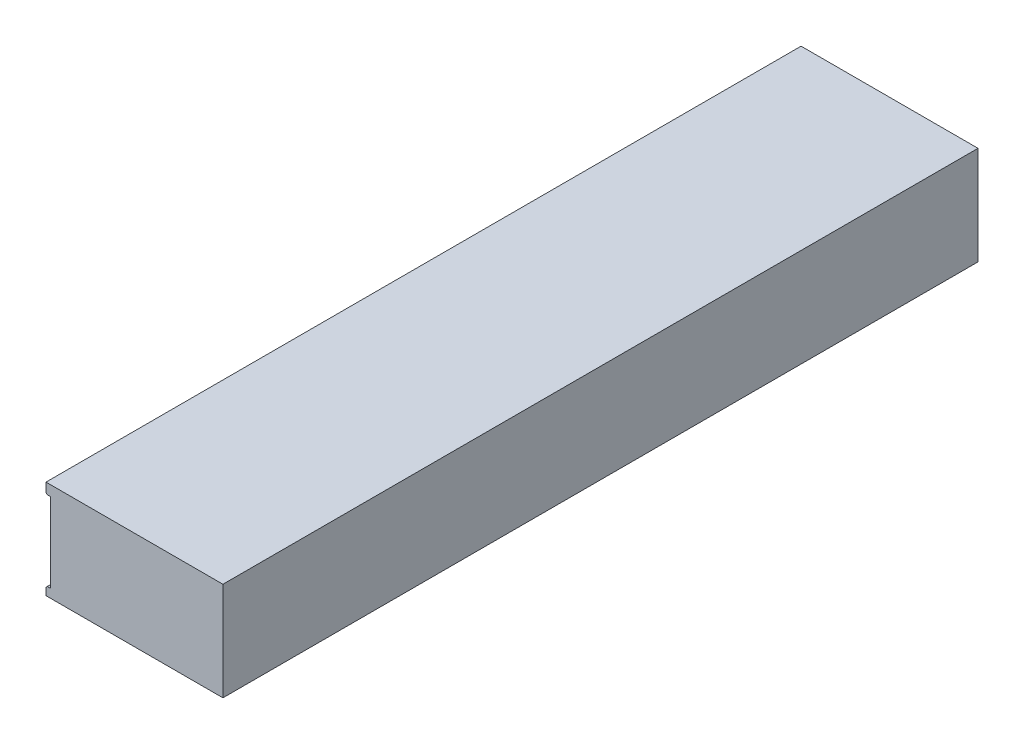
ISO-10303-21;
HEADER;
FILE_DESCRIPTION(('STEP AP214'),'2;1');
FILE_NAME('part.step','',(''),(''),'','','');
FILE_SCHEMA(('AUTOMOTIVE_DESIGN { 1 0 10303 214 1 1 1 1 }'));
ENDSEC;
DATA;
#1=APPLICATION_CONTEXT('core data for automotive mechanical design processes');
#2=APPLICATION_PROTOCOL_DEFINITION('international standard','automotive_design',2000,#1);
#3=PRODUCT_CONTEXT('',#1,'mechanical');
#4=PRODUCT('Part','Part','',(#3));
#5=PRODUCT_RELATED_PRODUCT_CATEGORY('part','',(#4));
#6=PRODUCT_DEFINITION_FORMATION('','',#4);
#7=PRODUCT_DEFINITION_CONTEXT('part definition',#1,'design');
#8=PRODUCT_DEFINITION('design','',#6,#7);
#9=PRODUCT_DEFINITION_SHAPE('','',#8);
#10=(LENGTH_UNIT() NAMED_UNIT(*) SI_UNIT(.MILLI.,.METRE.));
#11=(NAMED_UNIT(*) PLANE_ANGLE_UNIT() SI_UNIT($,.RADIAN.));
#12=(NAMED_UNIT(*) SI_UNIT($,.STERADIAN.) SOLID_ANGLE_UNIT());
#13=UNCERTAINTY_MEASURE_WITH_UNIT(LENGTH_MEASURE(1.E-05),#10,'distance_accuracy_value','');
#14=(GEOMETRIC_REPRESENTATION_CONTEXT(3) GLOBAL_UNCERTAINTY_ASSIGNED_CONTEXT((#13)) GLOBAL_UNIT_ASSIGNED_CONTEXT((#10,
#11,#12)) REPRESENTATION_CONTEXT('',''));
#15=CARTESIAN_POINT('',(0.,0.,0.));
#16=DIRECTION('',(0.,0.,1.));
#17=DIRECTION('',(1.,0.,0.));
#18=AXIS2_PLACEMENT_3D('',#15,#16,#17);
#19=CARTESIAN_POINT('',(-1.39699999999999,0.,111.1123));
#20=DIRECTION('',(0.,-1.,0.));
#21=DIRECTION('',(0.,0.,-1.));
#22=AXIS2_PLACEMENT_3D('',#19,#20,#21);
#23=PLANE('',#22);
#24=DIRECTION('',(-1.,0.,0.));
#25=VECTOR('',#24,1.);
#26=CARTESIAN_POINT('',(-1.39699999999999,0.,-111.1123));
#27=LINE('',#26,#25);
#28=CARTESIAN_POINT('',(50.673,0.,-111.1123));
#29=VERTEX_POINT('',#28);
#30=CARTESIAN_POINT('',(-1.39699999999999,0.,-111.1123));
#31=VERTEX_POINT('',#30);
#32=EDGE_CURVE('E360',#29,#31,#27,.T.);
#33=ORIENTED_EDGE('',*,*,#32,.T.);
#34=DIRECTION('',(0.,0.,-1.));
#35=VECTOR('',#34,1.);
#36=CARTESIAN_POINT('',(-1.39699999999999,0.,111.1123));
#37=LINE('',#36,#35);
#38=CARTESIAN_POINT('',(-1.39699999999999,0.,111.1123));
#39=VERTEX_POINT('',#38);
#40=EDGE_CURVE('E411',#39,#31,#37,.T.);
#41=ORIENTED_EDGE('',*,*,#40,.F.);
#42=DIRECTION('',(-1.,0.,0.));
#43=VECTOR('',#42,1.);
#44=CARTESIAN_POINT('',(-1.39699999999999,0.,111.1123));
#45=LINE('',#44,#43);
#46=CARTESIAN_POINT('',(50.673,0.,111.1123));
#47=VERTEX_POINT('',#46);
#48=EDGE_CURVE('E361',#47,#39,#45,.T.);
#49=ORIENTED_EDGE('',*,*,#48,.F.);
#50=DIRECTION('',(0.,0.,-1.));
#51=VECTOR('',#50,1.);
#52=CARTESIAN_POINT('',(50.673,0.,111.1123));
#53=LINE('',#52,#51);
#54=EDGE_CURVE('E380',#47,#29,#53,.T.);
#55=ORIENTED_EDGE('',*,*,#54,.T.);
#56=EDGE_LOOP('',(#33,#41,#49,#55));
#57=FACE_BOUND('',#56,.T.);
#58=ADVANCED_FACE('F37',(#57),#23,.F.);
#59=CARTESIAN_POINT('',(-1.39699999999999,-3.048,111.1123));
#60=DIRECTION('',(1.,0.,0.));
#61=DIRECTION('',(0.,0.,-1.));
#62=AXIS2_PLACEMENT_3D('',#59,#60,#61);
#63=PLANE('',#62);
#64=DIRECTION('',(0.,-1.,0.));
#65=VECTOR('',#64,1.);
#66=CARTESIAN_POINT('',(-1.39699999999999,-3.048,-111.1123));
#67=LINE('',#66,#65);
#68=CARTESIAN_POINT('',(-1.39699999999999,-2.66700000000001,-111.1123));
#69=VERTEX_POINT('',#68);
#70=EDGE_CURVE('E383',#31,#69,#67,.T.);
#71=ORIENTED_EDGE('',*,*,#70,.T.);
#72=DIRECTION('',(0.,0.,1.));
#73=VECTOR('',#72,1.);
#74=CARTESIAN_POINT('',(-1.39699999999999,-2.66700000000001,111.1123));
#75=LINE('',#74,#73);
#76=CARTESIAN_POINT('',(-1.39699999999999,-2.66700000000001,111.1123));
#77=VERTEX_POINT('',#76);
#78=EDGE_CURVE('E11',#69,#77,#75,.T.);
#79=ORIENTED_EDGE('',*,*,#78,.T.);
#80=DIRECTION('',(0.,-1.,0.));
#81=VECTOR('',#80,1.);
#82=CARTESIAN_POINT('',(-1.39699999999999,-3.048,111.1123));
#83=LINE('',#82,#81);
#84=EDGE_CURVE('E364',#39,#77,#83,.T.);
#85=ORIENTED_EDGE('',*,*,#84,.F.);
#86=ORIENTED_EDGE('',*,*,#40,.T.);
#87=EDGE_LOOP('',(#71,#79,#85,#86));
#88=FACE_BOUND('',#87,.T.);
#89=ADVANCED_FACE('F467',(#88),#63,.F.);
#90=CARTESIAN_POINT('',(0.,-3.048,111.1123));
#91=DIRECTION('',(0.,1.,0.));
#92=DIRECTION('',(0.,0.,1.));
#93=AXIS2_PLACEMENT_3D('',#90,#91,#92);
#94=PLANE('',#93);
#95=DIRECTION('',(1.,0.,0.));
#96=VECTOR('',#95,1.);
#97=CARTESIAN_POINT('',(0.,-3.048,111.1123));
#98=LINE('',#97,#96);
#99=CARTESIAN_POINT('',(-1.01599999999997,-3.048,111.1123));
#100=VERTEX_POINT('',#99);
#101=CARTESIAN_POINT('',(0.,-3.048,111.1123));
#102=VERTEX_POINT('',#101);
#103=EDGE_CURVE('E367',#100,#102,#98,.T.);
#104=ORIENTED_EDGE('',*,*,#103,.F.);
#105=DIRECTION('',(0.,0.,-1.));
#106=VECTOR('',#105,1.);
#107=CARTESIAN_POINT('',(-1.01599999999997,-3.048,111.1123));
#108=LINE('',#107,#106);
#109=CARTESIAN_POINT('',(-1.01599999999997,-3.048,-111.1123));
#110=VERTEX_POINT('',#109);
#111=EDGE_CURVE('E45',#100,#110,#108,.T.);
#112=ORIENTED_EDGE('',*,*,#111,.T.);
#113=DIRECTION('',(1.,0.,0.));
#114=VECTOR('',#113,1.);
#115=CARTESIAN_POINT('',(0.,-3.048,-111.1123));
#116=LINE('',#115,#114);
#117=CARTESIAN_POINT('',(0.,-3.048,-111.1123));
#118=VERTEX_POINT('',#117);
#119=EDGE_CURVE('E385',#110,#118,#116,.T.);
#120=ORIENTED_EDGE('',*,*,#119,.T.);
#121=DIRECTION('',(0.,0.,-1.));
#122=VECTOR('',#121,1.);
#123=CARTESIAN_POINT('',(0.,-3.048,111.1123));
#124=LINE('',#123,#122);
#125=EDGE_CURVE('E408',#102,#118,#124,.T.);
#126=ORIENTED_EDGE('',*,*,#125,.F.);
#127=EDGE_LOOP('',(#104,#112,#120,#126));
#128=FACE_BOUND('',#127,.T.);
#129=ADVANCED_FACE('F429',(#128),#94,.F.);
#130=CARTESIAN_POINT('',(0.,-26.416,111.1123));
#131=DIRECTION('',(1.,0.,0.));
#132=DIRECTION('',(0.,0.,-1.));
#133=AXIS2_PLACEMENT_3D('',#130,#131,#132);
#134=PLANE('',#133);
#135=CARTESIAN_POINT('',(0.,-6.35000000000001,-106.2482));
#136=DIRECTION('',(-1.,0.,0.));
#137=DIRECTION('',(0.,0.,1.));
#138=AXIS2_PLACEMENT_3D('',#135,#136,#137);
#139=CIRCLE('',#138,2.413);
#140=CARTESIAN_POINT('',(0.,-6.35000000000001,-103.8352));
#141=VERTEX_POINT('',#140);
#142=EDGE_CURVE('E177',#141,#141,#139,.T.);
#143=ORIENTED_EDGE('',*,*,#142,.F.);
#144=EDGE_LOOP('',(#143));
#145=FACE_BOUND('',#144,.T.);
#146=CARTESIAN_POINT('',(0.,-6.34999999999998,106.2482));
#147=DIRECTION('',(-1.,0.,0.));
#148=DIRECTION('',(0.,0.,1.));
#149=AXIS2_PLACEMENT_3D('',#146,#147,#148);
#150=CIRCLE('',#149,2.413);
#151=CARTESIAN_POINT('',(0.,-6.34999999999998,108.6612));
#152=VERTEX_POINT('',#151);
#153=EDGE_CURVE('E189',#152,#152,#150,.T.);
#154=ORIENTED_EDGE('',*,*,#153,.F.);
#155=EDGE_LOOP('',(#154));
#156=FACE_BOUND('',#155,.T.);
#157=CARTESIAN_POINT('',(0.,-6.34999999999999,4.8768));
#158=DIRECTION('',(-1.,0.,0.));
#159=DIRECTION('',(0.,0.,1.));
#160=AXIS2_PLACEMENT_3D('',#157,#158,#159);
#161=CIRCLE('',#160,2.413);
#162=CARTESIAN_POINT('',(0.,-6.34999999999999,7.2898));
#163=VERTEX_POINT('',#162);
#164=EDGE_CURVE('E201',#163,#163,#161,.T.);
#165=ORIENTED_EDGE('',*,*,#164,.F.);
#166=EDGE_LOOP('',(#165));
#167=FACE_BOUND('',#166,.T.);
#168=CARTESIAN_POINT('',(0.,-6.34999999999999,-4.8768));
#169=DIRECTION('',(-1.,0.,0.));
#170=DIRECTION('',(0.,0.,1.));
#171=AXIS2_PLACEMENT_3D('',#168,#169,#170);
#172=CIRCLE('',#171,2.413);
#173=CARTESIAN_POINT('',(0.,-6.34999999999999,-2.4638));
#174=VERTEX_POINT('',#173);
#175=EDGE_CURVE('E213',#174,#174,#172,.T.);
#176=ORIENTED_EDGE('',*,*,#175,.F.);
#177=EDGE_LOOP('',(#176));
#178=FACE_BOUND('',#177,.T.);
#179=CARTESIAN_POINT('',(0.,-23.114,-106.2482));
#180=DIRECTION('',(-1.,0.,0.));
#181=DIRECTION('',(0.,0.,1.));
#182=AXIS2_PLACEMENT_3D('',#179,#180,#181);
#183=CIRCLE('',#182,2.413);
#184=CARTESIAN_POINT('',(0.,-23.114,-103.8352));
#185=VERTEX_POINT('',#184);
#186=EDGE_CURVE('E225',#185,#185,#183,.T.);
#187=ORIENTED_EDGE('',*,*,#186,.F.);
#188=EDGE_LOOP('',(#187));
#189=FACE_BOUND('',#188,.T.);
#190=CARTESIAN_POINT('',(0.,-23.114,-4.8768));
#191=DIRECTION('',(-1.,0.,0.));
#192=DIRECTION('',(0.,0.,1.));
#193=AXIS2_PLACEMENT_3D('',#190,#191,#192);
#194=CIRCLE('',#193,2.413);
#195=CARTESIAN_POINT('',(0.,-23.114,-2.4638));
#196=VERTEX_POINT('',#195);
#197=EDGE_CURVE('E237',#196,#196,#194,.T.);
#198=ORIENTED_EDGE('',*,*,#197,.F.);
#199=EDGE_LOOP('',(#198));
#200=FACE_BOUND('',#199,.T.);
#201=CARTESIAN_POINT('',(0.,-23.114,4.8768));
#202=DIRECTION('',(-1.,0.,0.));
#203=DIRECTION('',(0.,0.,1.));
#204=AXIS2_PLACEMENT_3D('',#201,#202,#203);
#205=CIRCLE('',#204,2.413);
#206=CARTESIAN_POINT('',(0.,-23.114,7.2898));
#207=VERTEX_POINT('',#206);
#208=EDGE_CURVE('E249',#207,#207,#205,.T.);
#209=ORIENTED_EDGE('',*,*,#208,.F.);
#210=EDGE_LOOP('',(#209));
#211=FACE_BOUND('',#210,.T.);
#212=CARTESIAN_POINT('',(0.,-23.114,106.2482));
#213=DIRECTION('',(-1.,0.,0.));
#214=DIRECTION('',(0.,0.,1.));
#215=AXIS2_PLACEMENT_3D('',#212,#213,#214);
#216=CIRCLE('',#215,2.413);
#217=CARTESIAN_POINT('',(0.,-23.114,108.6612));
#218=VERTEX_POINT('',#217);
#219=EDGE_CURVE('E261',#218,#218,#216,.T.);
#220=ORIENTED_EDGE('',*,*,#219,.F.);
#221=EDGE_LOOP('',(#220));
#222=FACE_BOUND('',#221,.T.);
#223=CARTESIAN_POINT('',(0.,-6.34999999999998,-60.4266));
#224=DIRECTION('',(-1.,0.,0.));
#225=DIRECTION('',(0.,0.,1.));
#226=AXIS2_PLACEMENT_3D('',#223,#224,#225);
#227=CIRCLE('',#226,2.413);
#228=CARTESIAN_POINT('',(0.,-6.34999999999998,-58.0136));
#229=VERTEX_POINT('',#228);
#230=EDGE_CURVE('E273',#229,#229,#227,.T.);
#231=ORIENTED_EDGE('',*,*,#230,.F.);
#232=EDGE_LOOP('',(#231));
#233=FACE_BOUND('',#232,.T.);
#234=CARTESIAN_POINT('',(0.,-6.34999999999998,-50.673));
#235=DIRECTION('',(-1.,0.,0.));
#236=DIRECTION('',(0.,0.,1.));
#237=AXIS2_PLACEMENT_3D('',#234,#235,#236);
#238=CIRCLE('',#237,2.413);
#239=CARTESIAN_POINT('',(0.,-6.34999999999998,-48.26));
#240=VERTEX_POINT('',#239);
#241=EDGE_CURVE('E285',#240,#240,#238,.T.);
#242=ORIENTED_EDGE('',*,*,#241,.F.);
#243=EDGE_LOOP('',(#242));
#244=FACE_BOUND('',#243,.T.);
#245=CARTESIAN_POINT('',(0.,-23.114,-50.673));
#246=DIRECTION('',(-1.,0.,0.));
#247=DIRECTION('',(0.,0.,1.));
#248=AXIS2_PLACEMENT_3D('',#245,#246,#247);
#249=CIRCLE('',#248,2.413);
#250=CARTESIAN_POINT('',(0.,-23.114,-48.26));
#251=VERTEX_POINT('',#250);
#252=EDGE_CURVE('E297',#251,#251,#249,.T.);
#253=ORIENTED_EDGE('',*,*,#252,.F.);
#254=EDGE_LOOP('',(#253));
#255=FACE_BOUND('',#254,.T.);
#256=CARTESIAN_POINT('',(0.,-23.114,-60.4266));
#257=DIRECTION('',(-1.,0.,0.));
#258=DIRECTION('',(0.,0.,1.));
#259=AXIS2_PLACEMENT_3D('',#256,#257,#258);
#260=CIRCLE('',#259,2.413);
#261=CARTESIAN_POINT('',(0.,-23.114,-58.0136));
#262=VERTEX_POINT('',#261);
#263=EDGE_CURVE('E309',#262,#262,#260,.T.);
#264=ORIENTED_EDGE('',*,*,#263,.F.);
#265=EDGE_LOOP('',(#264));
#266=FACE_BOUND('',#265,.T.);
#267=CARTESIAN_POINT('',(0.,-6.34999999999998,50.673));
#268=DIRECTION('',(-1.,0.,0.));
#269=DIRECTION('',(0.,0.,1.));
#270=AXIS2_PLACEMENT_3D('',#267,#268,#269);
#271=CIRCLE('',#270,2.413);
#272=CARTESIAN_POINT('',(0.,-6.34999999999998,53.086));
#273=VERTEX_POINT('',#272);
#274=EDGE_CURVE('E321',#273,#273,#271,.T.);
#275=ORIENTED_EDGE('',*,*,#274,.F.);
#276=EDGE_LOOP('',(#275));
#277=FACE_BOUND('',#276,.T.);
#278=CARTESIAN_POINT('',(0.,-6.34999999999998,60.4266));
#279=DIRECTION('',(-1.,0.,0.));
#280=DIRECTION('',(0.,0.,1.));
#281=AXIS2_PLACEMENT_3D('',#278,#279,#280);
#282=CIRCLE('',#281,2.413);
#283=CARTESIAN_POINT('',(0.,-6.34999999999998,62.8396));
#284=VERTEX_POINT('',#283);
#285=EDGE_CURVE('E333',#284,#284,#282,.T.);
#286=ORIENTED_EDGE('',*,*,#285,.F.);
#287=EDGE_LOOP('',(#286));
#288=FACE_BOUND('',#287,.T.);
#289=CARTESIAN_POINT('',(0.,-23.114,60.4266));
#290=DIRECTION('',(-1.,0.,0.));
#291=DIRECTION('',(0.,0.,1.));
#292=AXIS2_PLACEMENT_3D('',#289,#290,#291);
#293=CIRCLE('',#292,2.413);
#294=CARTESIAN_POINT('',(0.,-23.114,62.8396));
#295=VERTEX_POINT('',#294);
#296=EDGE_CURVE('E345',#295,#295,#293,.T.);
#297=ORIENTED_EDGE('',*,*,#296,.F.);
#298=EDGE_LOOP('',(#297));
#299=FACE_BOUND('',#298,.T.);
#300=CARTESIAN_POINT('',(0.,-23.114,50.673));
#301=DIRECTION('',(-1.,0.,0.));
#302=DIRECTION('',(0.,0.,1.));
#303=AXIS2_PLACEMENT_3D('',#300,#301,#302);
#304=CIRCLE('',#303,2.413);
#305=CARTESIAN_POINT('',(0.,-23.114,53.086));
#306=VERTEX_POINT('',#305);
#307=EDGE_CURVE('E357',#306,#306,#304,.T.);
#308=ORIENTED_EDGE('',*,*,#307,.F.);
#309=EDGE_LOOP('',(#308));
#310=FACE_BOUND('',#309,.T.);
#311=DIRECTION('',(0.,-1.,0.));
#312=VECTOR('',#311,1.);
#313=CARTESIAN_POINT('',(0.,-26.416,-111.1123));
#314=LINE('',#313,#312);
#315=CARTESIAN_POINT('',(0.,-26.416,-111.1123));
#316=VERTEX_POINT('',#315);
#317=EDGE_CURVE('E387',#118,#316,#314,.T.);
#318=ORIENTED_EDGE('',*,*,#317,.T.);
#319=DIRECTION('',(0.,0.,-1.));
#320=VECTOR('',#319,1.);
#321=CARTESIAN_POINT('',(0.,-26.416,111.1123));
#322=LINE('',#321,#320);
#323=CARTESIAN_POINT('',(0.,-26.416,111.1123));
#324=VERTEX_POINT('',#323);
#325=EDGE_CURVE('E405',#324,#316,#322,.T.);
#326=ORIENTED_EDGE('',*,*,#325,.F.);
#327=DIRECTION('',(0.,-1.,0.));
#328=VECTOR('',#327,1.);
#329=CARTESIAN_POINT('',(0.,-26.416,111.1123));
#330=LINE('',#329,#328);
#331=EDGE_CURVE('E369',#102,#324,#330,.T.);
#332=ORIENTED_EDGE('',*,*,#331,.F.);
#333=ORIENTED_EDGE('',*,*,#125,.T.);
#334=EDGE_LOOP('',(#318,#326,#332,#333));
#335=FACE_BOUND('',#334,.T.);
#336=ADVANCED_FACE('F439',(#145,#156,#167,#178,#189,#200,#211,#222,#233,#244,#255,#266,#277,
#288,#299,#310,#335),#134,.F.);
#337=CARTESIAN_POINT('',(-1.39699999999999,-26.416,111.1123));
#338=DIRECTION('',(0.,-1.,0.));
#339=DIRECTION('',(0.,0.,-1.));
#340=AXIS2_PLACEMENT_3D('',#337,#338,#339);
#341=PLANE('',#340);
#342=DIRECTION('',(-1.,0.,0.));
#343=VECTOR('',#342,1.);
#344=CARTESIAN_POINT('',(-1.39699999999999,-26.416,-111.1123));
#345=LINE('',#344,#343);
#346=CARTESIAN_POINT('',(-1.016,-26.416,-111.1123));
#347=VERTEX_POINT('',#346);
#348=EDGE_CURVE('E389',#316,#347,#345,.T.);
#349=ORIENTED_EDGE('',*,*,#348,.T.);
#350=DIRECTION('',(0.,0.,1.));
#351=VECTOR('',#350,1.);
#352=CARTESIAN_POINT('',(-1.016,-26.416,111.1123));
#353=LINE('',#352,#351);
#354=CARTESIAN_POINT('',(-1.016,-26.416,111.1123));
#355=VERTEX_POINT('',#354);
#356=EDGE_CURVE('E421',#347,#355,#353,.T.);
#357=ORIENTED_EDGE('',*,*,#356,.T.);
#358=DIRECTION('',(-1.,0.,0.));
#359=VECTOR('',#358,1.);
#360=CARTESIAN_POINT('',(-1.39699999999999,-26.416,111.1123));
#361=LINE('',#360,#359);
#362=EDGE_CURVE('E371',#324,#355,#361,.T.);
#363=ORIENTED_EDGE('',*,*,#362,.F.);
#364=ORIENTED_EDGE('',*,*,#325,.T.);
#365=EDGE_LOOP('',(#349,#357,#363,#364));
#366=FACE_BOUND('',#365,.T.);
#367=ADVANCED_FACE('F443',(#366),#341,.F.);
#368=CARTESIAN_POINT('',(-1.39699999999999,-28.956,111.1123));
#369=DIRECTION('',(1.,0.,0.));
#370=DIRECTION('',(0.,1.,0.));
#371=AXIS2_PLACEMENT_3D('',#368,#369,#370);
#372=PLANE('',#371);
#373=DIRECTION('',(0.,-1.,0.));
#374=VECTOR('',#373,1.);
#375=CARTESIAN_POINT('',(-1.39699999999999,-28.956,111.1123));
#376=LINE('',#375,#374);
#377=CARTESIAN_POINT('',(-1.39699999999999,-26.797,111.1123));
#378=VERTEX_POINT('',#377);
#379=CARTESIAN_POINT('',(-1.39699999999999,-28.956,111.1123));
#380=VERTEX_POINT('',#379);
#381=EDGE_CURVE('E374',#378,#380,#376,.T.);
#382=ORIENTED_EDGE('',*,*,#381,.F.);
#383=DIRECTION('',(0.,0.,-1.));
#384=VECTOR('',#383,1.);
#385=CARTESIAN_POINT('',(-1.39699999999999,-26.797,111.1123));
#386=LINE('',#385,#384);
#387=CARTESIAN_POINT('',(-1.39699999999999,-26.797,-111.1123));
#388=VERTEX_POINT('',#387);
#389=EDGE_CURVE('E414',#378,#388,#386,.T.);
#390=ORIENTED_EDGE('',*,*,#389,.T.);
#391=DIRECTION('',(0.,-1.,0.));
#392=VECTOR('',#391,1.);
#393=CARTESIAN_POINT('',(-1.39699999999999,-28.956,-111.1123));
#394=LINE('',#393,#392);
#395=CARTESIAN_POINT('',(-1.39699999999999,-28.956,-111.1123));
#396=VERTEX_POINT('',#395);
#397=EDGE_CURVE('E392',#388,#396,#394,.T.);
#398=ORIENTED_EDGE('',*,*,#397,.T.);
#399=DIRECTION('',(0.,0.,-1.));
#400=VECTOR('',#399,1.);
#401=CARTESIAN_POINT('',(-1.39699999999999,-28.956,111.1123));
#402=LINE('',#401,#400);
#403=EDGE_CURVE('E402',#380,#396,#402,.T.);
#404=ORIENTED_EDGE('',*,*,#403,.F.);
#405=EDGE_LOOP('',(#382,#390,#398,#404));
#406=FACE_BOUND('',#405,.T.);
#407=ADVANCED_FACE('F451',(#406),#372,.F.);
#408=CARTESIAN_POINT('',(50.673,-28.956,111.1123));
#409=DIRECTION('',(0.,1.,0.));
#410=DIRECTION('',(-1.,0.,0.));
#411=AXIS2_PLACEMENT_3D('',#408,#409,#410);
#412=PLANE('',#411);
#413=DIRECTION('',(1.,0.,0.));
#414=VECTOR('',#413,1.);
#415=CARTESIAN_POINT('',(50.673,-28.956,-111.1123));
#416=LINE('',#415,#414);
#417=CARTESIAN_POINT('',(50.673,-28.956,-111.1123));
#418=VERTEX_POINT('',#417);
#419=EDGE_CURVE('E394',#396,#418,#416,.T.);
#420=ORIENTED_EDGE('',*,*,#419,.T.);
#421=DIRECTION('',(0.,0.,-1.));
#422=VECTOR('',#421,1.);
#423=CARTESIAN_POINT('',(50.673,-28.956,111.1123));
#424=LINE('',#423,#422);
#425=CARTESIAN_POINT('',(50.673,-28.956,111.1123));
#426=VERTEX_POINT('',#425);
#427=EDGE_CURVE('E399',#426,#418,#424,.T.);
#428=ORIENTED_EDGE('',*,*,#427,.F.);
#429=DIRECTION('',(1.,0.,0.));
#430=VECTOR('',#429,1.);
#431=CARTESIAN_POINT('',(50.673,-28.956,111.1123));
#432=LINE('',#431,#430);
#433=EDGE_CURVE('E376',#380,#426,#432,.T.);
#434=ORIENTED_EDGE('',*,*,#433,.F.);
#435=ORIENTED_EDGE('',*,*,#403,.T.);
#436=EDGE_LOOP('',(#420,#428,#434,#435));
#437=FACE_BOUND('',#436,.T.);
#438=ADVANCED_FACE('F458',(#437),#412,.F.);
#439=CARTESIAN_POINT('',(50.673,0.,111.1123));
#440=DIRECTION('',(-1.,0.,0.));
#441=DIRECTION('',(0.,-1.,0.));
#442=AXIS2_PLACEMENT_3D('',#439,#440,#441);
#443=PLANE('',#442);
#444=DIRECTION('',(0.,1.,0.));
#445=VECTOR('',#444,1.);
#446=CARTESIAN_POINT('',(50.673,0.,-111.1123));
#447=LINE('',#446,#445);
#448=EDGE_CURVE('E365',#418,#29,#447,.T.);
#449=ORIENTED_EDGE('',*,*,#448,.T.);
#450=ORIENTED_EDGE('',*,*,#54,.F.);
#451=DIRECTION('',(0.,1.,0.));
#452=VECTOR('',#451,1.);
#453=CARTESIAN_POINT('',(50.673,0.,111.1123));
#454=LINE('',#453,#452);
#455=EDGE_CURVE('E378',#426,#47,#454,.T.);
#456=ORIENTED_EDGE('',*,*,#455,.F.);
#457=ORIENTED_EDGE('',*,*,#427,.T.);
#458=EDGE_LOOP('',(#449,#450,#456,#457));
#459=FACE_BOUND('',#458,.T.);
#460=ADVANCED_FACE('F462',(#459),#443,.F.);
#461=CARTESIAN_POINT('',(0.,0.,111.1123));
#462=DIRECTION('',(0.,0.,1.));
#463=DIRECTION('',(1.,0.,0.));
#464=AXIS2_PLACEMENT_3D('',#461,#462,#463);
#465=PLANE('',#464);
#466=ORIENTED_EDGE('',*,*,#362,.T.);
#467=DIRECTION('',(0.707106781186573,0.707106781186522,0.));
#468=VECTOR('',#467,1.);
#469=CARTESIAN_POINT('',(12.7,-12.700000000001,111.1123));
#470=LINE('',#469,#468);
#471=EDGE_CURVE('E424',#355,#378,#470,.F.);
#472=ORIENTED_EDGE('',*,*,#471,.T.);
#473=ORIENTED_EDGE('',*,*,#381,.T.);
#474=ORIENTED_EDGE('',*,*,#433,.T.);
#475=ORIENTED_EDGE('',*,*,#455,.T.);
#476=ORIENTED_EDGE('',*,*,#48,.T.);
#477=ORIENTED_EDGE('',*,*,#84,.T.);
#478=DIRECTION('',(-0.707106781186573,0.707106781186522,0.));
#479=VECTOR('',#478,1.);
#480=CARTESIAN_POINT('',(-2.03199999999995,-2.0320000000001,111.1123));
#481=LINE('',#480,#479);
#482=EDGE_CURVE('E52',#77,#100,#481,.F.);
#483=ORIENTED_EDGE('',*,*,#482,.T.);
#484=ORIENTED_EDGE('',*,*,#103,.T.);
#485=ORIENTED_EDGE('',*,*,#331,.T.);
#486=EDGE_LOOP('',(#466,#472,#473,#474,#475,#476,#477,#483,#484,#485));
#487=FACE_BOUND('',#486,.T.);
#488=ADVANCED_FACE('F446',(#487),#465,.T.);
#489=CARTESIAN_POINT('',(0.,0.,-111.1123));
#490=DIRECTION('',(0.,0.,1.));
#491=DIRECTION('',(1.,0.,0.));
#492=AXIS2_PLACEMENT_3D('',#489,#490,#491);
#493=PLANE('',#492);
#494=ORIENTED_EDGE('',*,*,#397,.F.);
#495=DIRECTION('',(-0.707106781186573,-0.707106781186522,0.));
#496=VECTOR('',#495,1.);
#497=CARTESIAN_POINT('',(-1.39699999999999,-26.797,-111.1123));
#498=LINE('',#497,#496);
#499=EDGE_CURVE('E419',#388,#347,#498,.F.);
#500=ORIENTED_EDGE('',*,*,#499,.T.);
#501=ORIENTED_EDGE('',*,*,#348,.F.);
#502=ORIENTED_EDGE('',*,*,#317,.F.);
#503=ORIENTED_EDGE('',*,*,#119,.F.);
#504=DIRECTION('',(0.707106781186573,-0.707106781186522,0.));
#505=VECTOR('',#504,1.);
#506=CARTESIAN_POINT('',(-1.01599999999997,-3.048,-111.1123));
#507=LINE('',#506,#505);
#508=EDGE_CURVE('E417',#110,#69,#507,.F.);
#509=ORIENTED_EDGE('',*,*,#508,.T.);
#510=ORIENTED_EDGE('',*,*,#70,.F.);
#511=ORIENTED_EDGE('',*,*,#32,.F.);
#512=ORIENTED_EDGE('',*,*,#448,.F.);
#513=ORIENTED_EDGE('',*,*,#419,.F.);
#514=EDGE_LOOP('',(#494,#500,#501,#502,#503,#509,#510,#511,#512,#513));
#515=FACE_BOUND('',#514,.T.);
#516=ADVANCED_FACE('F435',(#515),#493,.F.);
#517=CARTESIAN_POINT('',(0.,-23.114,50.673));
#518=DIRECTION('',(-1.,0.,0.));
#519=DIRECTION('',(0.,0.,1.));
#520=AXIS2_PLACEMENT_3D('',#517,#518,#519);
#521=CYLINDRICAL_SURFACE('',#520,2.413);
#522=CARTESIAN_POINT('',(7.62,-23.114,50.673));
#523=DIRECTION('',(-1.,0.,0.));
#524=DIRECTION('',(0.,0.,1.));
#525=AXIS2_PLACEMENT_3D('',#522,#523,#524);
#526=CIRCLE('',#525,2.413);
#527=CARTESIAN_POINT('',(7.62,-23.114,53.086));
#528=VERTEX_POINT('',#527);
#529=EDGE_CURVE('E354',#528,#528,#526,.T.);
#530=ORIENTED_EDGE('',*,*,#529,.F.);
#531=EDGE_LOOP('',(#530));
#532=FACE_BOUND('',#531,.T.);
#533=ORIENTED_EDGE('',*,*,#307,.T.);
#534=EDGE_LOOP('',(#533));
#535=FACE_BOUND('',#534,.T.);
#536=ADVANCED_FACE('F494',(#532,#535),#521,.F.);
#537=CARTESIAN_POINT('',(7.62,-21.0947,50.673));
#538=DIRECTION('',(1.,0.,0.));
#539=DIRECTION('',(0.,0.,-1.));
#540=AXIS2_PLACEMENT_3D('',#537,#538,#539);
#541=PLANE('',#540);
#542=CARTESIAN_POINT('',(7.62,-23.114,50.673));
#543=DIRECTION('',(-1.,0.,0.));
#544=DIRECTION('',(0.,0.,1.));
#545=AXIS2_PLACEMENT_3D('',#542,#543,#544);
#546=CIRCLE('',#545,2.0193);
#547=CARTESIAN_POINT('',(7.62,-23.114,52.6923));
#548=VERTEX_POINT('',#547);
#549=EDGE_CURVE('E351',#548,#548,#546,.T.);
#550=ORIENTED_EDGE('',*,*,#549,.F.);
#551=EDGE_LOOP('',(#550));
#552=FACE_BOUND('',#551,.T.);
#553=ORIENTED_EDGE('',*,*,#529,.T.);
#554=EDGE_LOOP('',(#553));
#555=FACE_BOUND('',#554,.T.);
#556=ADVANCED_FACE('F499',(#552,#555),#541,.F.);
#557=CARTESIAN_POINT('',(0.,-23.114,50.673));
#558=DIRECTION('',(-1.,0.,0.));
#559=DIRECTION('',(0.,0.,1.));
#560=AXIS2_PLACEMENT_3D('',#557,#558,#559);
#561=CYLINDRICAL_SURFACE('',#560,2.0193);
#562=CARTESIAN_POINT('',(9.99744,-23.114,50.673));
#563=DIRECTION('',(-1.,0.,0.));
#564=DIRECTION('',(0.,0.,1.));
#565=AXIS2_PLACEMENT_3D('',#562,#563,#564);
#566=CIRCLE('',#565,2.0193);
#567=CARTESIAN_POINT('',(9.99744,-23.114,52.6923));
#568=VERTEX_POINT('',#567);
#569=EDGE_CURVE('E348',#568,#568,#566,.T.);
#570=ORIENTED_EDGE('',*,*,#569,.F.);
#571=EDGE_LOOP('',(#570));
#572=FACE_BOUND('',#571,.T.);
#573=ORIENTED_EDGE('',*,*,#549,.T.);
#574=EDGE_LOOP('',(#573));
#575=FACE_BOUND('',#574,.T.);
#576=ADVANCED_FACE('F503',(#572,#575),#561,.F.);
#577=CARTESIAN_POINT('',(9.99744,-23.114,50.673));
#578=DIRECTION('',(-1.,0.,0.));
#579=DIRECTION('',(0.,0.,1.));
#580=AXIS2_PLACEMENT_3D('',#577,#578,#579);
#581=CONICAL_SURFACE('',#580,2.0193,1.02974425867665);
#582=CARTESIAN_POINT('',(11.2107578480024,-23.114,50.673));
#583=VERTEX_POINT('',#582);
#584=VERTEX_LOOP('',#583);
#585=FACE_BOUND('',#584,.T.);
#586=ORIENTED_EDGE('',*,*,#569,.T.);
#587=EDGE_LOOP('',(#586));
#588=FACE_BOUND('',#587,.T.);
#589=ADVANCED_FACE('F507',(#585,#588),#581,.F.);
#590=CARTESIAN_POINT('',(0.,-23.114,60.4266));
#591=DIRECTION('',(-1.,0.,0.));
#592=DIRECTION('',(0.,0.,1.));
#593=AXIS2_PLACEMENT_3D('',#590,#591,#592);
#594=CYLINDRICAL_SURFACE('',#593,2.413);
#595=CARTESIAN_POINT('',(7.62,-23.114,60.4266));
#596=DIRECTION('',(-1.,0.,0.));
#597=DIRECTION('',(0.,0.,1.));
#598=AXIS2_PLACEMENT_3D('',#595,#596,#597);
#599=CIRCLE('',#598,2.413);
#600=CARTESIAN_POINT('',(7.62,-23.114,62.8396));
#601=VERTEX_POINT('',#600);
#602=EDGE_CURVE('E342',#601,#601,#599,.T.);
#603=ORIENTED_EDGE('',*,*,#602,.F.);
#604=EDGE_LOOP('',(#603));
#605=FACE_BOUND('',#604,.T.);
#606=ORIENTED_EDGE('',*,*,#296,.T.);
#607=EDGE_LOOP('',(#606));
#608=FACE_BOUND('',#607,.T.);
#609=ADVANCED_FACE('F511',(#605,#608),#594,.F.);
#610=CARTESIAN_POINT('',(7.62,-21.0947,60.4266));
#611=DIRECTION('',(1.,0.,0.));
#612=DIRECTION('',(0.,0.,-1.));
#613=AXIS2_PLACEMENT_3D('',#610,#611,#612);
#614=PLANE('',#613);
#615=CARTESIAN_POINT('',(7.62,-23.114,60.4266));
#616=DIRECTION('',(-1.,0.,0.));
#617=DIRECTION('',(0.,0.,1.));
#618=AXIS2_PLACEMENT_3D('',#615,#616,#617);
#619=CIRCLE('',#618,2.0193);
#620=CARTESIAN_POINT('',(7.62,-23.114,62.4459));
#621=VERTEX_POINT('',#620);
#622=EDGE_CURVE('E339',#621,#621,#619,.T.);
#623=ORIENTED_EDGE('',*,*,#622,.F.);
#624=EDGE_LOOP('',(#623));
#625=FACE_BOUND('',#624,.T.);
#626=ORIENTED_EDGE('',*,*,#602,.T.);
#627=EDGE_LOOP('',(#626));
#628=FACE_BOUND('',#627,.T.);
#629=ADVANCED_FACE('F515',(#625,#628),#614,.F.);
#630=CARTESIAN_POINT('',(0.,-23.114,60.4266));
#631=DIRECTION('',(-1.,0.,0.));
#632=DIRECTION('',(0.,0.,1.));
#633=AXIS2_PLACEMENT_3D('',#630,#631,#632);
#634=CYLINDRICAL_SURFACE('',#633,2.0193);
#635=CARTESIAN_POINT('',(9.99744,-23.114,60.4266));
#636=DIRECTION('',(-1.,0.,0.));
#637=DIRECTION('',(0.,0.,1.));
#638=AXIS2_PLACEMENT_3D('',#635,#636,#637);
#639=CIRCLE('',#638,2.0193);
#640=CARTESIAN_POINT('',(9.99744,-23.114,62.4459));
#641=VERTEX_POINT('',#640);
#642=EDGE_CURVE('E336',#641,#641,#639,.T.);
#643=ORIENTED_EDGE('',*,*,#642,.F.);
#644=EDGE_LOOP('',(#643));
#645=FACE_BOUND('',#644,.T.);
#646=ORIENTED_EDGE('',*,*,#622,.T.);
#647=EDGE_LOOP('',(#646));
#648=FACE_BOUND('',#647,.T.);
#649=ADVANCED_FACE('F519',(#645,#648),#634,.F.);
#650=CARTESIAN_POINT('',(9.99744,-23.114,60.4266));
#651=DIRECTION('',(-1.,0.,0.));
#652=DIRECTION('',(0.,0.,1.));
#653=AXIS2_PLACEMENT_3D('',#650,#651,#652);
#654=CONICAL_SURFACE('',#653,2.0193,1.02974425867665);
#655=CARTESIAN_POINT('',(11.2107578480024,-23.114,60.4266));
#656=VERTEX_POINT('',#655);
#657=VERTEX_LOOP('',#656);
#658=FACE_BOUND('',#657,.T.);
#659=ORIENTED_EDGE('',*,*,#642,.T.);
#660=EDGE_LOOP('',(#659));
#661=FACE_BOUND('',#660,.T.);
#662=ADVANCED_FACE('F523',(#658,#661),#654,.F.);
#663=CARTESIAN_POINT('',(0.,-6.34999999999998,60.4266));
#664=DIRECTION('',(-1.,0.,0.));
#665=DIRECTION('',(0.,0.,1.));
#666=AXIS2_PLACEMENT_3D('',#663,#664,#665);
#667=CYLINDRICAL_SURFACE('',#666,2.413);
#668=CARTESIAN_POINT('',(7.62,-6.34999999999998,60.4266));
#669=DIRECTION('',(-1.,0.,0.));
#670=DIRECTION('',(0.,0.,1.));
#671=AXIS2_PLACEMENT_3D('',#668,#669,#670);
#672=CIRCLE('',#671,2.413);
#673=CARTESIAN_POINT('',(7.62,-6.34999999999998,62.8396));
#674=VERTEX_POINT('',#673);
#675=EDGE_CURVE('E330',#674,#674,#672,.T.);
#676=ORIENTED_EDGE('',*,*,#675,.F.);
#677=EDGE_LOOP('',(#676));
#678=FACE_BOUND('',#677,.T.);
#679=ORIENTED_EDGE('',*,*,#285,.T.);
#680=EDGE_LOOP('',(#679));
#681=FACE_BOUND('',#680,.T.);
#682=ADVANCED_FACE('F527',(#678,#681),#667,.F.);
#683=CARTESIAN_POINT('',(7.62,-4.33069999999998,60.4266));
#684=DIRECTION('',(1.,0.,0.));
#685=DIRECTION('',(0.,0.,-1.));
#686=AXIS2_PLACEMENT_3D('',#683,#684,#685);
#687=PLANE('',#686);
#688=CARTESIAN_POINT('',(7.62,-6.34999999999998,60.4266));
#689=DIRECTION('',(-1.,0.,0.));
#690=DIRECTION('',(0.,0.,1.));
#691=AXIS2_PLACEMENT_3D('',#688,#689,#690);
#692=CIRCLE('',#691,2.0193);
#693=CARTESIAN_POINT('',(7.62,-6.34999999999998,62.4459));
#694=VERTEX_POINT('',#693);
#695=EDGE_CURVE('E327',#694,#694,#692,.T.);
#696=ORIENTED_EDGE('',*,*,#695,.F.);
#697=EDGE_LOOP('',(#696));
#698=FACE_BOUND('',#697,.T.);
#699=ORIENTED_EDGE('',*,*,#675,.T.);
#700=EDGE_LOOP('',(#699));
#701=FACE_BOUND('',#700,.T.);
#702=ADVANCED_FACE('F531',(#698,#701),#687,.F.);
#703=CARTESIAN_POINT('',(0.,-6.34999999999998,60.4266));
#704=DIRECTION('',(-1.,0.,0.));
#705=DIRECTION('',(0.,0.,1.));
#706=AXIS2_PLACEMENT_3D('',#703,#704,#705);
#707=CYLINDRICAL_SURFACE('',#706,2.0193);
#708=CARTESIAN_POINT('',(9.99744,-6.34999999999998,60.4266));
#709=DIRECTION('',(-1.,0.,0.));
#710=DIRECTION('',(0.,0.,1.));
#711=AXIS2_PLACEMENT_3D('',#708,#709,#710);
#712=CIRCLE('',#711,2.0193);
#713=CARTESIAN_POINT('',(9.99744,-6.34999999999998,62.4459));
#714=VERTEX_POINT('',#713);
#715=EDGE_CURVE('E324',#714,#714,#712,.T.);
#716=ORIENTED_EDGE('',*,*,#715,.F.);
#717=EDGE_LOOP('',(#716));
#718=FACE_BOUND('',#717,.T.);
#719=ORIENTED_EDGE('',*,*,#695,.T.);
#720=EDGE_LOOP('',(#719));
#721=FACE_BOUND('',#720,.T.);
#722=ADVANCED_FACE('F535',(#718,#721),#707,.F.);
#723=CARTESIAN_POINT('',(9.99744,-6.34999999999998,60.4266));
#724=DIRECTION('',(-1.,0.,0.));
#725=DIRECTION('',(0.,0.,1.));
#726=AXIS2_PLACEMENT_3D('',#723,#724,#725);
#727=CONICAL_SURFACE('',#726,2.0193,1.02974425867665);
#728=CARTESIAN_POINT('',(11.2107578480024,-6.34999999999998,60.4266));
#729=VERTEX_POINT('',#728);
#730=VERTEX_LOOP('',#729);
#731=FACE_BOUND('',#730,.T.);
#732=ORIENTED_EDGE('',*,*,#715,.T.);
#733=EDGE_LOOP('',(#732));
#734=FACE_BOUND('',#733,.T.);
#735=ADVANCED_FACE('F539',(#731,#734),#727,.F.);
#736=CARTESIAN_POINT('',(0.,-6.34999999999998,50.673));
#737=DIRECTION('',(-1.,0.,0.));
#738=DIRECTION('',(0.,0.,1.));
#739=AXIS2_PLACEMENT_3D('',#736,#737,#738);
#740=CYLINDRICAL_SURFACE('',#739,2.413);
#741=CARTESIAN_POINT('',(7.62,-6.34999999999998,50.673));
#742=DIRECTION('',(-1.,0.,0.));
#743=DIRECTION('',(0.,0.,1.));
#744=AXIS2_PLACEMENT_3D('',#741,#742,#743);
#745=CIRCLE('',#744,2.413);
#746=CARTESIAN_POINT('',(7.62,-6.34999999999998,53.086));
#747=VERTEX_POINT('',#746);
#748=EDGE_CURVE('E318',#747,#747,#745,.T.);
#749=ORIENTED_EDGE('',*,*,#748,.F.);
#750=EDGE_LOOP('',(#749));
#751=FACE_BOUND('',#750,.T.);
#752=ORIENTED_EDGE('',*,*,#274,.T.);
#753=EDGE_LOOP('',(#752));
#754=FACE_BOUND('',#753,.T.);
#755=ADVANCED_FACE('F543',(#751,#754),#740,.F.);
#756=CARTESIAN_POINT('',(7.62,-4.33069999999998,50.673));
#757=DIRECTION('',(1.,0.,0.));
#758=DIRECTION('',(0.,0.,-1.));
#759=AXIS2_PLACEMENT_3D('',#756,#757,#758);
#760=PLANE('',#759);
#761=CARTESIAN_POINT('',(7.62,-6.34999999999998,50.673));
#762=DIRECTION('',(-1.,0.,0.));
#763=DIRECTION('',(0.,0.,1.));
#764=AXIS2_PLACEMENT_3D('',#761,#762,#763);
#765=CIRCLE('',#764,2.0193);
#766=CARTESIAN_POINT('',(7.62,-6.34999999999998,52.6923));
#767=VERTEX_POINT('',#766);
#768=EDGE_CURVE('E315',#767,#767,#765,.T.);
#769=ORIENTED_EDGE('',*,*,#768,.F.);
#770=EDGE_LOOP('',(#769));
#771=FACE_BOUND('',#770,.T.);
#772=ORIENTED_EDGE('',*,*,#748,.T.);
#773=EDGE_LOOP('',(#772));
#774=FACE_BOUND('',#773,.T.);
#775=ADVANCED_FACE('F547',(#771,#774),#760,.F.);
#776=CARTESIAN_POINT('',(0.,-6.34999999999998,50.673));
#777=DIRECTION('',(-1.,0.,0.));
#778=DIRECTION('',(0.,0.,1.));
#779=AXIS2_PLACEMENT_3D('',#776,#777,#778);
#780=CYLINDRICAL_SURFACE('',#779,2.0193);
#781=CARTESIAN_POINT('',(9.99744,-6.34999999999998,50.673));
#782=DIRECTION('',(-1.,0.,0.));
#783=DIRECTION('',(0.,0.,1.));
#784=AXIS2_PLACEMENT_3D('',#781,#782,#783);
#785=CIRCLE('',#784,2.0193);
#786=CARTESIAN_POINT('',(9.99744,-6.34999999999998,52.6923));
#787=VERTEX_POINT('',#786);
#788=EDGE_CURVE('E312',#787,#787,#785,.T.);
#789=ORIENTED_EDGE('',*,*,#788,.F.);
#790=EDGE_LOOP('',(#789));
#791=FACE_BOUND('',#790,.T.);
#792=ORIENTED_EDGE('',*,*,#768,.T.);
#793=EDGE_LOOP('',(#792));
#794=FACE_BOUND('',#793,.T.);
#795=ADVANCED_FACE('F551',(#791,#794),#780,.F.);
#796=CARTESIAN_POINT('',(9.99744,-6.34999999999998,50.673));
#797=DIRECTION('',(-1.,0.,0.));
#798=DIRECTION('',(0.,0.,1.));
#799=AXIS2_PLACEMENT_3D('',#796,#797,#798);
#800=CONICAL_SURFACE('',#799,2.0193,1.02974425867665);
#801=CARTESIAN_POINT('',(11.2107578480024,-6.34999999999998,50.673));
#802=VERTEX_POINT('',#801);
#803=VERTEX_LOOP('',#802);
#804=FACE_BOUND('',#803,.T.);
#805=ORIENTED_EDGE('',*,*,#788,.T.);
#806=EDGE_LOOP('',(#805));
#807=FACE_BOUND('',#806,.T.);
#808=ADVANCED_FACE('F555',(#804,#807),#800,.F.);
#809=CARTESIAN_POINT('',(0.,-23.114,-60.4266));
#810=DIRECTION('',(-1.,0.,0.));
#811=DIRECTION('',(0.,0.,1.));
#812=AXIS2_PLACEMENT_3D('',#809,#810,#811);
#813=CYLINDRICAL_SURFACE('',#812,2.413);
#814=CARTESIAN_POINT('',(7.62,-23.114,-60.4266));
#815=DIRECTION('',(-1.,0.,0.));
#816=DIRECTION('',(0.,0.,1.));
#817=AXIS2_PLACEMENT_3D('',#814,#815,#816);
#818=CIRCLE('',#817,2.413);
#819=CARTESIAN_POINT('',(7.62,-23.114,-58.0136));
#820=VERTEX_POINT('',#819);
#821=EDGE_CURVE('E306',#820,#820,#818,.T.);
#822=ORIENTED_EDGE('',*,*,#821,.F.);
#823=EDGE_LOOP('',(#822));
#824=FACE_BOUND('',#823,.T.);
#825=ORIENTED_EDGE('',*,*,#263,.T.);
#826=EDGE_LOOP('',(#825));
#827=FACE_BOUND('',#826,.T.);
#828=ADVANCED_FACE('F559',(#824,#827),#813,.F.);
#829=CARTESIAN_POINT('',(7.62,-21.0947,-60.4266));
#830=DIRECTION('',(1.,0.,0.));
#831=DIRECTION('',(0.,0.,-1.));
#832=AXIS2_PLACEMENT_3D('',#829,#830,#831);
#833=PLANE('',#832);
#834=CARTESIAN_POINT('',(7.62,-23.114,-60.4266));
#835=DIRECTION('',(-1.,0.,0.));
#836=DIRECTION('',(0.,0.,1.));
#837=AXIS2_PLACEMENT_3D('',#834,#835,#836);
#838=CIRCLE('',#837,2.0193);
#839=CARTESIAN_POINT('',(7.62,-23.114,-58.4073));
#840=VERTEX_POINT('',#839);
#841=EDGE_CURVE('E303',#840,#840,#838,.T.);
#842=ORIENTED_EDGE('',*,*,#841,.F.);
#843=EDGE_LOOP('',(#842));
#844=FACE_BOUND('',#843,.T.);
#845=ORIENTED_EDGE('',*,*,#821,.T.);
#846=EDGE_LOOP('',(#845));
#847=FACE_BOUND('',#846,.T.);
#848=ADVANCED_FACE('F563',(#844,#847),#833,.F.);
#849=CARTESIAN_POINT('',(0.,-23.114,-60.4266));
#850=DIRECTION('',(-1.,0.,0.));
#851=DIRECTION('',(0.,0.,1.));
#852=AXIS2_PLACEMENT_3D('',#849,#850,#851);
#853=CYLINDRICAL_SURFACE('',#852,2.0193);
#854=CARTESIAN_POINT('',(9.99744,-23.114,-60.4266));
#855=DIRECTION('',(-1.,0.,0.));
#856=DIRECTION('',(0.,0.,1.));
#857=AXIS2_PLACEMENT_3D('',#854,#855,#856);
#858=CIRCLE('',#857,2.0193);
#859=CARTESIAN_POINT('',(9.99744,-23.114,-58.4073));
#860=VERTEX_POINT('',#859);
#861=EDGE_CURVE('E300',#860,#860,#858,.T.);
#862=ORIENTED_EDGE('',*,*,#861,.F.);
#863=EDGE_LOOP('',(#862));
#864=FACE_BOUND('',#863,.T.);
#865=ORIENTED_EDGE('',*,*,#841,.T.);
#866=EDGE_LOOP('',(#865));
#867=FACE_BOUND('',#866,.T.);
#868=ADVANCED_FACE('F567',(#864,#867),#853,.F.);
#869=CARTESIAN_POINT('',(9.99744,-23.114,-60.4266));
#870=DIRECTION('',(-1.,0.,0.));
#871=DIRECTION('',(0.,0.,1.));
#872=AXIS2_PLACEMENT_3D('',#869,#870,#871);
#873=CONICAL_SURFACE('',#872,2.0193,1.02974425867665);
#874=CARTESIAN_POINT('',(11.2107578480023,-23.114,-60.4266));
#875=VERTEX_POINT('',#874);
#876=VERTEX_LOOP('',#875);
#877=FACE_BOUND('',#876,.T.);
#878=ORIENTED_EDGE('',*,*,#861,.T.);
#879=EDGE_LOOP('',(#878));
#880=FACE_BOUND('',#879,.T.);
#881=ADVANCED_FACE('F571',(#877,#880),#873,.F.);
#882=CARTESIAN_POINT('',(0.,-23.114,-50.673));
#883=DIRECTION('',(-1.,0.,0.));
#884=DIRECTION('',(0.,0.,1.));
#885=AXIS2_PLACEMENT_3D('',#882,#883,#884);
#886=CYLINDRICAL_SURFACE('',#885,2.413);
#887=CARTESIAN_POINT('',(7.62,-23.114,-50.673));
#888=DIRECTION('',(-1.,0.,0.));
#889=DIRECTION('',(0.,0.,1.));
#890=AXIS2_PLACEMENT_3D('',#887,#888,#889);
#891=CIRCLE('',#890,2.413);
#892=CARTESIAN_POINT('',(7.62,-23.114,-48.26));
#893=VERTEX_POINT('',#892);
#894=EDGE_CURVE('E294',#893,#893,#891,.T.);
#895=ORIENTED_EDGE('',*,*,#894,.F.);
#896=EDGE_LOOP('',(#895));
#897=FACE_BOUND('',#896,.T.);
#898=ORIENTED_EDGE('',*,*,#252,.T.);
#899=EDGE_LOOP('',(#898));
#900=FACE_BOUND('',#899,.T.);
#901=ADVANCED_FACE('F575',(#897,#900),#886,.F.);
#902=CARTESIAN_POINT('',(7.62,-21.0947,-50.673));
#903=DIRECTION('',(1.,0.,0.));
#904=DIRECTION('',(0.,0.,-1.));
#905=AXIS2_PLACEMENT_3D('',#902,#903,#904);
#906=PLANE('',#905);
#907=CARTESIAN_POINT('',(7.62,-23.114,-50.673));
#908=DIRECTION('',(-1.,0.,0.));
#909=DIRECTION('',(0.,0.,1.));
#910=AXIS2_PLACEMENT_3D('',#907,#908,#909);
#911=CIRCLE('',#910,2.0193);
#912=CARTESIAN_POINT('',(7.62,-23.114,-48.6537));
#913=VERTEX_POINT('',#912);
#914=EDGE_CURVE('E291',#913,#913,#911,.T.);
#915=ORIENTED_EDGE('',*,*,#914,.F.);
#916=EDGE_LOOP('',(#915));
#917=FACE_BOUND('',#916,.T.);
#918=ORIENTED_EDGE('',*,*,#894,.T.);
#919=EDGE_LOOP('',(#918));
#920=FACE_BOUND('',#919,.T.);
#921=ADVANCED_FACE('F579',(#917,#920),#906,.F.);
#922=CARTESIAN_POINT('',(0.,-23.114,-50.673));
#923=DIRECTION('',(-1.,0.,0.));
#924=DIRECTION('',(0.,0.,1.));
#925=AXIS2_PLACEMENT_3D('',#922,#923,#924);
#926=CYLINDRICAL_SURFACE('',#925,2.0193);
#927=CARTESIAN_POINT('',(9.99744,-23.114,-50.673));
#928=DIRECTION('',(-1.,0.,0.));
#929=DIRECTION('',(0.,0.,1.));
#930=AXIS2_PLACEMENT_3D('',#927,#928,#929);
#931=CIRCLE('',#930,2.0193);
#932=CARTESIAN_POINT('',(9.99744,-23.114,-48.6537));
#933=VERTEX_POINT('',#932);
#934=EDGE_CURVE('E288',#933,#933,#931,.T.);
#935=ORIENTED_EDGE('',*,*,#934,.F.);
#936=EDGE_LOOP('',(#935));
#937=FACE_BOUND('',#936,.T.);
#938=ORIENTED_EDGE('',*,*,#914,.T.);
#939=EDGE_LOOP('',(#938));
#940=FACE_BOUND('',#939,.T.);
#941=ADVANCED_FACE('F583',(#937,#940),#926,.F.);
#942=CARTESIAN_POINT('',(9.99744,-23.114,-50.673));
#943=DIRECTION('',(-1.,0.,0.));
#944=DIRECTION('',(0.,0.,1.));
#945=AXIS2_PLACEMENT_3D('',#942,#943,#944);
#946=CONICAL_SURFACE('',#945,2.0193,1.02974425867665);
#947=CARTESIAN_POINT('',(11.2107578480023,-23.114,-50.673));
#948=VERTEX_POINT('',#947);
#949=VERTEX_LOOP('',#948);
#950=FACE_BOUND('',#949,.T.);
#951=ORIENTED_EDGE('',*,*,#934,.T.);
#952=EDGE_LOOP('',(#951));
#953=FACE_BOUND('',#952,.T.);
#954=ADVANCED_FACE('F587',(#950,#953),#946,.F.);
#955=CARTESIAN_POINT('',(0.,-6.34999999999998,-50.673));
#956=DIRECTION('',(-1.,0.,0.));
#957=DIRECTION('',(0.,0.,1.));
#958=AXIS2_PLACEMENT_3D('',#955,#956,#957);
#959=CYLINDRICAL_SURFACE('',#958,2.413);
#960=CARTESIAN_POINT('',(7.62,-6.34999999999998,-50.673));
#961=DIRECTION('',(-1.,0.,0.));
#962=DIRECTION('',(0.,0.,1.));
#963=AXIS2_PLACEMENT_3D('',#960,#961,#962);
#964=CIRCLE('',#963,2.413);
#965=CARTESIAN_POINT('',(7.62,-6.34999999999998,-48.26));
#966=VERTEX_POINT('',#965);
#967=EDGE_CURVE('E282',#966,#966,#964,.T.);
#968=ORIENTED_EDGE('',*,*,#967,.F.);
#969=EDGE_LOOP('',(#968));
#970=FACE_BOUND('',#969,.T.);
#971=ORIENTED_EDGE('',*,*,#241,.T.);
#972=EDGE_LOOP('',(#971));
#973=FACE_BOUND('',#972,.T.);
#974=ADVANCED_FACE('F591',(#970,#973),#959,.F.);
#975=CARTESIAN_POINT('',(7.62,-4.33069999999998,-50.673));
#976=DIRECTION('',(1.,0.,0.));
#977=DIRECTION('',(0.,0.,-1.));
#978=AXIS2_PLACEMENT_3D('',#975,#976,#977);
#979=PLANE('',#978);
#980=CARTESIAN_POINT('',(7.62,-6.34999999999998,-50.673));
#981=DIRECTION('',(-1.,0.,0.));
#982=DIRECTION('',(0.,0.,1.));
#983=AXIS2_PLACEMENT_3D('',#980,#981,#982);
#984=CIRCLE('',#983,2.0193);
#985=CARTESIAN_POINT('',(7.62,-6.34999999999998,-48.6537));
#986=VERTEX_POINT('',#985);
#987=EDGE_CURVE('E279',#986,#986,#984,.T.);
#988=ORIENTED_EDGE('',*,*,#987,.F.);
#989=EDGE_LOOP('',(#988));
#990=FACE_BOUND('',#989,.T.);
#991=ORIENTED_EDGE('',*,*,#967,.T.);
#992=EDGE_LOOP('',(#991));
#993=FACE_BOUND('',#992,.T.);
#994=ADVANCED_FACE('F595',(#990,#993),#979,.F.);
#995=CARTESIAN_POINT('',(0.,-6.34999999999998,-50.673));
#996=DIRECTION('',(-1.,0.,0.));
#997=DIRECTION('',(0.,0.,1.));
#998=AXIS2_PLACEMENT_3D('',#995,#996,#997);
#999=CYLINDRICAL_SURFACE('',#998,2.0193);
#1000=CARTESIAN_POINT('',(9.99744,-6.34999999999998,-50.673));
#1001=DIRECTION('',(-1.,0.,0.));
#1002=DIRECTION('',(0.,0.,1.));
#1003=AXIS2_PLACEMENT_3D('',#1000,#1001,#1002);
#1004=CIRCLE('',#1003,2.0193);
#1005=CARTESIAN_POINT('',(9.99744,-6.34999999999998,-48.6537));
#1006=VERTEX_POINT('',#1005);
#1007=EDGE_CURVE('E276',#1006,#1006,#1004,.T.);
#1008=ORIENTED_EDGE('',*,*,#1007,.F.);
#1009=EDGE_LOOP('',(#1008));
#1010=FACE_BOUND('',#1009,.T.);
#1011=ORIENTED_EDGE('',*,*,#987,.T.);
#1012=EDGE_LOOP('',(#1011));
#1013=FACE_BOUND('',#1012,.T.);
#1014=ADVANCED_FACE('F599',(#1010,#1013),#999,.F.);
#1015=CARTESIAN_POINT('',(9.99744,-6.34999999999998,-50.673));
#1016=DIRECTION('',(-1.,0.,0.));
#1017=DIRECTION('',(0.,0.,1.));
#1018=AXIS2_PLACEMENT_3D('',#1015,#1016,#1017);
#1019=CONICAL_SURFACE('',#1018,2.0193,1.02974425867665);
#1020=CARTESIAN_POINT('',(11.2107578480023,-6.34999999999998,-50.673));
#1021=VERTEX_POINT('',#1020);
#1022=VERTEX_LOOP('',#1021);
#1023=FACE_BOUND('',#1022,.T.);
#1024=ORIENTED_EDGE('',*,*,#1007,.T.);
#1025=EDGE_LOOP('',(#1024));
#1026=FACE_BOUND('',#1025,.T.);
#1027=ADVANCED_FACE('F603',(#1023,#1026),#1019,.F.);
#1028=CARTESIAN_POINT('',(0.,-6.34999999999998,-60.4266));
#1029=DIRECTION('',(-1.,0.,0.));
#1030=DIRECTION('',(0.,0.,1.));
#1031=AXIS2_PLACEMENT_3D('',#1028,#1029,#1030);
#1032=CYLINDRICAL_SURFACE('',#1031,2.413);
#1033=CARTESIAN_POINT('',(7.62,-6.34999999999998,-60.4266));
#1034=DIRECTION('',(-1.,0.,0.));
#1035=DIRECTION('',(0.,0.,1.));
#1036=AXIS2_PLACEMENT_3D('',#1033,#1034,#1035);
#1037=CIRCLE('',#1036,2.413);
#1038=CARTESIAN_POINT('',(7.62,-6.34999999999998,-58.0136));
#1039=VERTEX_POINT('',#1038);
#1040=EDGE_CURVE('E270',#1039,#1039,#1037,.T.);
#1041=ORIENTED_EDGE('',*,*,#1040,.F.);
#1042=EDGE_LOOP('',(#1041));
#1043=FACE_BOUND('',#1042,.T.);
#1044=ORIENTED_EDGE('',*,*,#230,.T.);
#1045=EDGE_LOOP('',(#1044));
#1046=FACE_BOUND('',#1045,.T.);
#1047=ADVANCED_FACE('F607',(#1043,#1046),#1032,.F.);
#1048=CARTESIAN_POINT('',(7.62,-4.33069999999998,-60.4266));
#1049=DIRECTION('',(1.,0.,0.));
#1050=DIRECTION('',(0.,0.,-1.));
#1051=AXIS2_PLACEMENT_3D('',#1048,#1049,#1050);
#1052=PLANE('',#1051);
#1053=CARTESIAN_POINT('',(7.62,-6.34999999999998,-60.4266));
#1054=DIRECTION('',(-1.,0.,0.));
#1055=DIRECTION('',(0.,0.,1.));
#1056=AXIS2_PLACEMENT_3D('',#1053,#1054,#1055);
#1057=CIRCLE('',#1056,2.0193);
#1058=CARTESIAN_POINT('',(7.62,-6.34999999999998,-58.4073));
#1059=VERTEX_POINT('',#1058);
#1060=EDGE_CURVE('E267',#1059,#1059,#1057,.T.);
#1061=ORIENTED_EDGE('',*,*,#1060,.F.);
#1062=EDGE_LOOP('',(#1061));
#1063=FACE_BOUND('',#1062,.T.);
#1064=ORIENTED_EDGE('',*,*,#1040,.T.);
#1065=EDGE_LOOP('',(#1064));
#1066=FACE_BOUND('',#1065,.T.);
#1067=ADVANCED_FACE('F611',(#1063,#1066),#1052,.F.);
#1068=CARTESIAN_POINT('',(0.,-6.34999999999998,-60.4266));
#1069=DIRECTION('',(-1.,0.,0.));
#1070=DIRECTION('',(0.,0.,1.));
#1071=AXIS2_PLACEMENT_3D('',#1068,#1069,#1070);
#1072=CYLINDRICAL_SURFACE('',#1071,2.0193);
#1073=CARTESIAN_POINT('',(9.99744,-6.34999999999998,-60.4266));
#1074=DIRECTION('',(-1.,0.,0.));
#1075=DIRECTION('',(0.,0.,1.));
#1076=AXIS2_PLACEMENT_3D('',#1073,#1074,#1075);
#1077=CIRCLE('',#1076,2.0193);
#1078=CARTESIAN_POINT('',(9.99744,-6.34999999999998,-58.4073));
#1079=VERTEX_POINT('',#1078);
#1080=EDGE_CURVE('E264',#1079,#1079,#1077,.T.);
#1081=ORIENTED_EDGE('',*,*,#1080,.F.);
#1082=EDGE_LOOP('',(#1081));
#1083=FACE_BOUND('',#1082,.T.);
#1084=ORIENTED_EDGE('',*,*,#1060,.T.);
#1085=EDGE_LOOP('',(#1084));
#1086=FACE_BOUND('',#1085,.T.);
#1087=ADVANCED_FACE('F615',(#1083,#1086),#1072,.F.);
#1088=CARTESIAN_POINT('',(9.99744,-6.34999999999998,-60.4266));
#1089=DIRECTION('',(-1.,0.,0.));
#1090=DIRECTION('',(0.,0.,1.));
#1091=AXIS2_PLACEMENT_3D('',#1088,#1089,#1090);
#1092=CONICAL_SURFACE('',#1091,2.0193,1.02974425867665);
#1093=CARTESIAN_POINT('',(11.2107578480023,-6.34999999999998,-60.4266));
#1094=VERTEX_POINT('',#1093);
#1095=VERTEX_LOOP('',#1094);
#1096=FACE_BOUND('',#1095,.T.);
#1097=ORIENTED_EDGE('',*,*,#1080,.T.);
#1098=EDGE_LOOP('',(#1097));
#1099=FACE_BOUND('',#1098,.T.);
#1100=ADVANCED_FACE('F619',(#1096,#1099),#1092,.F.);
#1101=CARTESIAN_POINT('',(0.,-23.114,106.2482));
#1102=DIRECTION('',(-1.,0.,0.));
#1103=DIRECTION('',(0.,0.,1.));
#1104=AXIS2_PLACEMENT_3D('',#1101,#1102,#1103);
#1105=CYLINDRICAL_SURFACE('',#1104,2.413);
#1106=CARTESIAN_POINT('',(7.62000000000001,-23.114,106.2482));
#1107=DIRECTION('',(-1.,0.,0.));
#1108=DIRECTION('',(0.,0.,1.));
#1109=AXIS2_PLACEMENT_3D('',#1106,#1107,#1108);
#1110=CIRCLE('',#1109,2.413);
#1111=CARTESIAN_POINT('',(7.62000000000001,-23.114,108.6612));
#1112=VERTEX_POINT('',#1111);
#1113=EDGE_CURVE('E258',#1112,#1112,#1110,.T.);
#1114=ORIENTED_EDGE('',*,*,#1113,.F.);
#1115=EDGE_LOOP('',(#1114));
#1116=FACE_BOUND('',#1115,.T.);
#1117=ORIENTED_EDGE('',*,*,#219,.T.);
#1118=EDGE_LOOP('',(#1117));
#1119=FACE_BOUND('',#1118,.T.);
#1120=ADVANCED_FACE('F623',(#1116,#1119),#1105,.F.);
#1121=CARTESIAN_POINT('',(7.62000000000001,-21.0947,106.2482));
#1122=DIRECTION('',(1.,0.,0.));
#1123=DIRECTION('',(0.,0.,-1.));
#1124=AXIS2_PLACEMENT_3D('',#1121,#1122,#1123);
#1125=PLANE('',#1124);
#1126=CARTESIAN_POINT('',(7.62000000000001,-23.114,106.2482));
#1127=DIRECTION('',(-1.,0.,0.));
#1128=DIRECTION('',(0.,0.,1.));
#1129=AXIS2_PLACEMENT_3D('',#1126,#1127,#1128);
#1130=CIRCLE('',#1129,2.0193);
#1131=CARTESIAN_POINT('',(7.62000000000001,-23.114,108.2675));
#1132=VERTEX_POINT('',#1131);
#1133=EDGE_CURVE('E255',#1132,#1132,#1130,.T.);
#1134=ORIENTED_EDGE('',*,*,#1133,.F.);
#1135=EDGE_LOOP('',(#1134));
#1136=FACE_BOUND('',#1135,.T.);
#1137=ORIENTED_EDGE('',*,*,#1113,.T.);
#1138=EDGE_LOOP('',(#1137));
#1139=FACE_BOUND('',#1138,.T.);
#1140=ADVANCED_FACE('F627',(#1136,#1139),#1125,.F.);
#1141=CARTESIAN_POINT('',(0.,-23.114,106.2482));
#1142=DIRECTION('',(-1.,0.,0.));
#1143=DIRECTION('',(0.,0.,1.));
#1144=AXIS2_PLACEMENT_3D('',#1141,#1142,#1143);
#1145=CYLINDRICAL_SURFACE('',#1144,2.0193);
#1146=CARTESIAN_POINT('',(9.99744000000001,-23.114,106.2482));
#1147=DIRECTION('',(-1.,0.,0.));
#1148=DIRECTION('',(0.,0.,1.));
#1149=AXIS2_PLACEMENT_3D('',#1146,#1147,#1148);
#1150=CIRCLE('',#1149,2.0193);
#1151=CARTESIAN_POINT('',(9.99744000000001,-23.114,108.2675));
#1152=VERTEX_POINT('',#1151);
#1153=EDGE_CURVE('E252',#1152,#1152,#1150,.T.);
#1154=ORIENTED_EDGE('',*,*,#1153,.F.);
#1155=EDGE_LOOP('',(#1154));
#1156=FACE_BOUND('',#1155,.T.);
#1157=ORIENTED_EDGE('',*,*,#1133,.T.);
#1158=EDGE_LOOP('',(#1157));
#1159=FACE_BOUND('',#1158,.T.);
#1160=ADVANCED_FACE('F631',(#1156,#1159),#1145,.F.);
#1161=CARTESIAN_POINT('',(9.99744000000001,-23.114,106.2482));
#1162=DIRECTION('',(-1.,0.,0.));
#1163=DIRECTION('',(0.,0.,1.));
#1164=AXIS2_PLACEMENT_3D('',#1161,#1162,#1163);
#1165=CONICAL_SURFACE('',#1164,2.0193,1.02974425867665);
#1166=CARTESIAN_POINT('',(11.2107578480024,-23.114,106.2482));
#1167=VERTEX_POINT('',#1166);
#1168=VERTEX_LOOP('',#1167);
#1169=FACE_BOUND('',#1168,.T.);
#1170=ORIENTED_EDGE('',*,*,#1153,.T.);
#1171=EDGE_LOOP('',(#1170));
#1172=FACE_BOUND('',#1171,.T.);
#1173=ADVANCED_FACE('F635',(#1169,#1172),#1165,.F.);
#1174=CARTESIAN_POINT('',(0.,-23.114,4.8768));
#1175=DIRECTION('',(-1.,0.,0.));
#1176=DIRECTION('',(0.,0.,1.));
#1177=AXIS2_PLACEMENT_3D('',#1174,#1175,#1176);
#1178=CYLINDRICAL_SURFACE('',#1177,2.413);
#1179=CARTESIAN_POINT('',(7.62,-23.114,4.8768));
#1180=DIRECTION('',(-1.,0.,0.));
#1181=DIRECTION('',(0.,0.,1.));
#1182=AXIS2_PLACEMENT_3D('',#1179,#1180,#1181);
#1183=CIRCLE('',#1182,2.413);
#1184=CARTESIAN_POINT('',(7.62,-23.114,7.2898));
#1185=VERTEX_POINT('',#1184);
#1186=EDGE_CURVE('E246',#1185,#1185,#1183,.T.);
#1187=ORIENTED_EDGE('',*,*,#1186,.F.);
#1188=EDGE_LOOP('',(#1187));
#1189=FACE_BOUND('',#1188,.T.);
#1190=ORIENTED_EDGE('',*,*,#208,.T.);
#1191=EDGE_LOOP('',(#1190));
#1192=FACE_BOUND('',#1191,.T.);
#1193=ADVANCED_FACE('F639',(#1189,#1192),#1178,.F.);
#1194=CARTESIAN_POINT('',(7.62,-21.0947,4.8768));
#1195=DIRECTION('',(1.,0.,0.));
#1196=DIRECTION('',(0.,0.,-1.));
#1197=AXIS2_PLACEMENT_3D('',#1194,#1195,#1196);
#1198=PLANE('',#1197);
#1199=CARTESIAN_POINT('',(7.62,-23.114,4.8768));
#1200=DIRECTION('',(-1.,0.,0.));
#1201=DIRECTION('',(0.,0.,1.));
#1202=AXIS2_PLACEMENT_3D('',#1199,#1200,#1201);
#1203=CIRCLE('',#1202,2.0193);
#1204=CARTESIAN_POINT('',(7.62,-23.114,6.8961));
#1205=VERTEX_POINT('',#1204);
#1206=EDGE_CURVE('E243',#1205,#1205,#1203,.T.);
#1207=ORIENTED_EDGE('',*,*,#1206,.F.);
#1208=EDGE_LOOP('',(#1207));
#1209=FACE_BOUND('',#1208,.T.);
#1210=ORIENTED_EDGE('',*,*,#1186,.T.);
#1211=EDGE_LOOP('',(#1210));
#1212=FACE_BOUND('',#1211,.T.);
#1213=ADVANCED_FACE('F643',(#1209,#1212),#1198,.F.);
#1214=CARTESIAN_POINT('',(0.,-23.114,4.8768));
#1215=DIRECTION('',(-1.,0.,0.));
#1216=DIRECTION('',(0.,0.,1.));
#1217=AXIS2_PLACEMENT_3D('',#1214,#1215,#1216);
#1218=CYLINDRICAL_SURFACE('',#1217,2.0193);
#1219=CARTESIAN_POINT('',(9.99744,-23.114,4.8768));
#1220=DIRECTION('',(-1.,0.,0.));
#1221=DIRECTION('',(0.,0.,1.));
#1222=AXIS2_PLACEMENT_3D('',#1219,#1220,#1221);
#1223=CIRCLE('',#1222,2.0193);
#1224=CARTESIAN_POINT('',(9.99744,-23.114,6.8961));
#1225=VERTEX_POINT('',#1224);
#1226=EDGE_CURVE('E240',#1225,#1225,#1223,.T.);
#1227=ORIENTED_EDGE('',*,*,#1226,.F.);
#1228=EDGE_LOOP('',(#1227));
#1229=FACE_BOUND('',#1228,.T.);
#1230=ORIENTED_EDGE('',*,*,#1206,.T.);
#1231=EDGE_LOOP('',(#1230));
#1232=FACE_BOUND('',#1231,.T.);
#1233=ADVANCED_FACE('F647',(#1229,#1232),#1218,.F.);
#1234=CARTESIAN_POINT('',(9.99744,-23.114,4.8768));
#1235=DIRECTION('',(-1.,0.,0.));
#1236=DIRECTION('',(0.,0.,1.));
#1237=AXIS2_PLACEMENT_3D('',#1234,#1235,#1236);
#1238=CONICAL_SURFACE('',#1237,2.0193,1.02974425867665);
#1239=CARTESIAN_POINT('',(11.2107578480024,-23.114,4.8768));
#1240=VERTEX_POINT('',#1239);
#1241=VERTEX_LOOP('',#1240);
#1242=FACE_BOUND('',#1241,.T.);
#1243=ORIENTED_EDGE('',*,*,#1226,.T.);
#1244=EDGE_LOOP('',(#1243));
#1245=FACE_BOUND('',#1244,.T.);
#1246=ADVANCED_FACE('F651',(#1242,#1245),#1238,.F.);
#1247=CARTESIAN_POINT('',(0.,-23.114,-4.8768));
#1248=DIRECTION('',(-1.,0.,0.));
#1249=DIRECTION('',(0.,0.,1.));
#1250=AXIS2_PLACEMENT_3D('',#1247,#1248,#1249);
#1251=CYLINDRICAL_SURFACE('',#1250,2.413);
#1252=CARTESIAN_POINT('',(7.62,-23.114,-4.8768));
#1253=DIRECTION('',(-1.,0.,0.));
#1254=DIRECTION('',(0.,0.,1.));
#1255=AXIS2_PLACEMENT_3D('',#1252,#1253,#1254);
#1256=CIRCLE('',#1255,2.413);
#1257=CARTESIAN_POINT('',(7.62,-23.114,-2.4638));
#1258=VERTEX_POINT('',#1257);
#1259=EDGE_CURVE('E234',#1258,#1258,#1256,.T.);
#1260=ORIENTED_EDGE('',*,*,#1259,.F.);
#1261=EDGE_LOOP('',(#1260));
#1262=FACE_BOUND('',#1261,.T.);
#1263=ORIENTED_EDGE('',*,*,#197,.T.);
#1264=EDGE_LOOP('',(#1263));
#1265=FACE_BOUND('',#1264,.T.);
#1266=ADVANCED_FACE('F655',(#1262,#1265),#1251,.F.);
#1267=CARTESIAN_POINT('',(7.62,-21.0947,-4.8768));
#1268=DIRECTION('',(1.,0.,0.));
#1269=DIRECTION('',(0.,0.,-1.));
#1270=AXIS2_PLACEMENT_3D('',#1267,#1268,#1269);
#1271=PLANE('',#1270);
#1272=CARTESIAN_POINT('',(7.62,-23.114,-4.8768));
#1273=DIRECTION('',(-1.,0.,0.));
#1274=DIRECTION('',(0.,0.,1.));
#1275=AXIS2_PLACEMENT_3D('',#1272,#1273,#1274);
#1276=CIRCLE('',#1275,2.0193);
#1277=CARTESIAN_POINT('',(7.62,-23.114,-2.8575));
#1278=VERTEX_POINT('',#1277);
#1279=EDGE_CURVE('E231',#1278,#1278,#1276,.T.);
#1280=ORIENTED_EDGE('',*,*,#1279,.F.);
#1281=EDGE_LOOP('',(#1280));
#1282=FACE_BOUND('',#1281,.T.);
#1283=ORIENTED_EDGE('',*,*,#1259,.T.);
#1284=EDGE_LOOP('',(#1283));
#1285=FACE_BOUND('',#1284,.T.);
#1286=ADVANCED_FACE('F659',(#1282,#1285),#1271,.F.);
#1287=CARTESIAN_POINT('',(0.,-23.114,-4.8768));
#1288=DIRECTION('',(-1.,0.,0.));
#1289=DIRECTION('',(0.,0.,1.));
#1290=AXIS2_PLACEMENT_3D('',#1287,#1288,#1289);
#1291=CYLINDRICAL_SURFACE('',#1290,2.0193);
#1292=CARTESIAN_POINT('',(9.99744,-23.114,-4.8768));
#1293=DIRECTION('',(-1.,0.,0.));
#1294=DIRECTION('',(0.,0.,1.));
#1295=AXIS2_PLACEMENT_3D('',#1292,#1293,#1294);
#1296=CIRCLE('',#1295,2.0193);
#1297=CARTESIAN_POINT('',(9.99744,-23.114,-2.8575));
#1298=VERTEX_POINT('',#1297);
#1299=EDGE_CURVE('E228',#1298,#1298,#1296,.T.);
#1300=ORIENTED_EDGE('',*,*,#1299,.F.);
#1301=EDGE_LOOP('',(#1300));
#1302=FACE_BOUND('',#1301,.T.);
#1303=ORIENTED_EDGE('',*,*,#1279,.T.);
#1304=EDGE_LOOP('',(#1303));
#1305=FACE_BOUND('',#1304,.T.);
#1306=ADVANCED_FACE('F663',(#1302,#1305),#1291,.F.);
#1307=CARTESIAN_POINT('',(9.99744,-23.114,-4.8768));
#1308=DIRECTION('',(-1.,0.,0.));
#1309=DIRECTION('',(0.,0.,1.));
#1310=AXIS2_PLACEMENT_3D('',#1307,#1308,#1309);
#1311=CONICAL_SURFACE('',#1310,2.0193,1.02974425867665);
#1312=CARTESIAN_POINT('',(11.2107578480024,-23.114,-4.8768));
#1313=VERTEX_POINT('',#1312);
#1314=VERTEX_LOOP('',#1313);
#1315=FACE_BOUND('',#1314,.T.);
#1316=ORIENTED_EDGE('',*,*,#1299,.T.);
#1317=EDGE_LOOP('',(#1316));
#1318=FACE_BOUND('',#1317,.T.);
#1319=ADVANCED_FACE('F667',(#1315,#1318),#1311,.F.);
#1320=CARTESIAN_POINT('',(0.,-23.114,-106.2482));
#1321=DIRECTION('',(-1.,0.,0.));
#1322=DIRECTION('',(0.,0.,1.));
#1323=AXIS2_PLACEMENT_3D('',#1320,#1321,#1322);
#1324=CYLINDRICAL_SURFACE('',#1323,2.413);
#1325=CARTESIAN_POINT('',(7.61999999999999,-23.114,-106.2482));
#1326=DIRECTION('',(-1.,0.,0.));
#1327=DIRECTION('',(0.,0.,1.));
#1328=AXIS2_PLACEMENT_3D('',#1325,#1326,#1327);
#1329=CIRCLE('',#1328,2.413);
#1330=CARTESIAN_POINT('',(7.61999999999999,-23.114,-103.8352));
#1331=VERTEX_POINT('',#1330);
#1332=EDGE_CURVE('E222',#1331,#1331,#1329,.T.);
#1333=ORIENTED_EDGE('',*,*,#1332,.F.);
#1334=EDGE_LOOP('',(#1333));
#1335=FACE_BOUND('',#1334,.T.);
#1336=ORIENTED_EDGE('',*,*,#186,.T.);
#1337=EDGE_LOOP('',(#1336));
#1338=FACE_BOUND('',#1337,.T.);
#1339=ADVANCED_FACE('F671',(#1335,#1338),#1324,.F.);
#1340=CARTESIAN_POINT('',(7.61999999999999,-21.0947,-106.2482));
#1341=DIRECTION('',(1.,0.,0.));
#1342=DIRECTION('',(0.,0.,-1.));
#1343=AXIS2_PLACEMENT_3D('',#1340,#1341,#1342);
#1344=PLANE('',#1343);
#1345=CARTESIAN_POINT('',(7.61999999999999,-23.114,-106.2482));
#1346=DIRECTION('',(-1.,0.,0.));
#1347=DIRECTION('',(0.,0.,1.));
#1348=AXIS2_PLACEMENT_3D('',#1345,#1346,#1347);
#1349=CIRCLE('',#1348,2.0193);
#1350=CARTESIAN_POINT('',(7.61999999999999,-23.114,-104.2289));
#1351=VERTEX_POINT('',#1350);
#1352=EDGE_CURVE('E219',#1351,#1351,#1349,.T.);
#1353=ORIENTED_EDGE('',*,*,#1352,.F.);
#1354=EDGE_LOOP('',(#1353));
#1355=FACE_BOUND('',#1354,.T.);
#1356=ORIENTED_EDGE('',*,*,#1332,.T.);
#1357=EDGE_LOOP('',(#1356));
#1358=FACE_BOUND('',#1357,.T.);
#1359=ADVANCED_FACE('F675',(#1355,#1358),#1344,.F.);
#1360=CARTESIAN_POINT('',(0.,-23.114,-106.2482));
#1361=DIRECTION('',(-1.,0.,0.));
#1362=DIRECTION('',(0.,0.,1.));
#1363=AXIS2_PLACEMENT_3D('',#1360,#1361,#1362);
#1364=CYLINDRICAL_SURFACE('',#1363,2.0193);
#1365=CARTESIAN_POINT('',(9.99743999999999,-23.114,-106.2482));
#1366=DIRECTION('',(-1.,0.,0.));
#1367=DIRECTION('',(0.,0.,1.));
#1368=AXIS2_PLACEMENT_3D('',#1365,#1366,#1367);
#1369=CIRCLE('',#1368,2.0193);
#1370=CARTESIAN_POINT('',(9.99743999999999,-23.114,-104.2289));
#1371=VERTEX_POINT('',#1370);
#1372=EDGE_CURVE('E216',#1371,#1371,#1369,.T.);
#1373=ORIENTED_EDGE('',*,*,#1372,.F.);
#1374=EDGE_LOOP('',(#1373));
#1375=FACE_BOUND('',#1374,.T.);
#1376=ORIENTED_EDGE('',*,*,#1352,.T.);
#1377=EDGE_LOOP('',(#1376));
#1378=FACE_BOUND('',#1377,.T.);
#1379=ADVANCED_FACE('F679',(#1375,#1378),#1364,.F.);
#1380=CARTESIAN_POINT('',(9.99743999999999,-23.114,-106.2482));
#1381=DIRECTION('',(-1.,0.,0.));
#1382=DIRECTION('',(0.,0.,1.));
#1383=AXIS2_PLACEMENT_3D('',#1380,#1381,#1382);
#1384=CONICAL_SURFACE('',#1383,2.0193,1.02974425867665);
#1385=CARTESIAN_POINT('',(11.2107578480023,-23.114,-106.2482));
#1386=VERTEX_POINT('',#1385);
#1387=VERTEX_LOOP('',#1386);
#1388=FACE_BOUND('',#1387,.T.);
#1389=ORIENTED_EDGE('',*,*,#1372,.T.);
#1390=EDGE_LOOP('',(#1389));
#1391=FACE_BOUND('',#1390,.T.);
#1392=ADVANCED_FACE('F683',(#1388,#1391),#1384,.F.);
#1393=CARTESIAN_POINT('',(0.,-6.34999999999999,-4.8768));
#1394=DIRECTION('',(-1.,0.,0.));
#1395=DIRECTION('',(0.,0.,1.));
#1396=AXIS2_PLACEMENT_3D('',#1393,#1394,#1395);
#1397=CYLINDRICAL_SURFACE('',#1396,2.413);
#1398=CARTESIAN_POINT('',(7.62,-6.34999999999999,-4.8768));
#1399=DIRECTION('',(-1.,0.,0.));
#1400=DIRECTION('',(0.,0.,1.));
#1401=AXIS2_PLACEMENT_3D('',#1398,#1399,#1400);
#1402=CIRCLE('',#1401,2.413);
#1403=CARTESIAN_POINT('',(7.62,-6.34999999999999,-2.4638));
#1404=VERTEX_POINT('',#1403);
#1405=EDGE_CURVE('E210',#1404,#1404,#1402,.T.);
#1406=ORIENTED_EDGE('',*,*,#1405,.F.);
#1407=EDGE_LOOP('',(#1406));
#1408=FACE_BOUND('',#1407,.T.);
#1409=ORIENTED_EDGE('',*,*,#175,.T.);
#1410=EDGE_LOOP('',(#1409));
#1411=FACE_BOUND('',#1410,.T.);
#1412=ADVANCED_FACE('F687',(#1408,#1411),#1397,.F.);
#1413=CARTESIAN_POINT('',(7.62,-4.33069999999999,-4.8768));
#1414=DIRECTION('',(1.,0.,0.));
#1415=DIRECTION('',(0.,0.,-1.));
#1416=AXIS2_PLACEMENT_3D('',#1413,#1414,#1415);
#1417=PLANE('',#1416);
#1418=CARTESIAN_POINT('',(7.62,-6.34999999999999,-4.8768));
#1419=DIRECTION('',(-1.,0.,0.));
#1420=DIRECTION('',(0.,0.,1.));
#1421=AXIS2_PLACEMENT_3D('',#1418,#1419,#1420);
#1422=CIRCLE('',#1421,2.0193);
#1423=CARTESIAN_POINT('',(7.62,-6.34999999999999,-2.8575));
#1424=VERTEX_POINT('',#1423);
#1425=EDGE_CURVE('E207',#1424,#1424,#1422,.T.);
#1426=ORIENTED_EDGE('',*,*,#1425,.F.);
#1427=EDGE_LOOP('',(#1426));
#1428=FACE_BOUND('',#1427,.T.);
#1429=ORIENTED_EDGE('',*,*,#1405,.T.);
#1430=EDGE_LOOP('',(#1429));
#1431=FACE_BOUND('',#1430,.T.);
#1432=ADVANCED_FACE('F691',(#1428,#1431),#1417,.F.);
#1433=CARTESIAN_POINT('',(0.,-6.34999999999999,-4.8768));
#1434=DIRECTION('',(-1.,0.,0.));
#1435=DIRECTION('',(0.,0.,1.));
#1436=AXIS2_PLACEMENT_3D('',#1433,#1434,#1435);
#1437=CYLINDRICAL_SURFACE('',#1436,2.0193);
#1438=CARTESIAN_POINT('',(9.99744,-6.34999999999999,-4.8768));
#1439=DIRECTION('',(-1.,0.,0.));
#1440=DIRECTION('',(0.,0.,1.));
#1441=AXIS2_PLACEMENT_3D('',#1438,#1439,#1440);
#1442=CIRCLE('',#1441,2.0193);
#1443=CARTESIAN_POINT('',(9.99744,-6.34999999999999,-2.8575));
#1444=VERTEX_POINT('',#1443);
#1445=EDGE_CURVE('E204',#1444,#1444,#1442,.T.);
#1446=ORIENTED_EDGE('',*,*,#1445,.F.);
#1447=EDGE_LOOP('',(#1446));
#1448=FACE_BOUND('',#1447,.T.);
#1449=ORIENTED_EDGE('',*,*,#1425,.T.);
#1450=EDGE_LOOP('',(#1449));
#1451=FACE_BOUND('',#1450,.T.);
#1452=ADVANCED_FACE('F695',(#1448,#1451),#1437,.F.);
#1453=CARTESIAN_POINT('',(9.99744,-6.34999999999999,-4.8768));
#1454=DIRECTION('',(-1.,0.,0.));
#1455=DIRECTION('',(0.,0.,1.));
#1456=AXIS2_PLACEMENT_3D('',#1453,#1454,#1455);
#1457=CONICAL_SURFACE('',#1456,2.0193,1.02974425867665);
#1458=CARTESIAN_POINT('',(11.2107578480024,-6.34999999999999,-4.8768));
#1459=VERTEX_POINT('',#1458);
#1460=VERTEX_LOOP('',#1459);
#1461=FACE_BOUND('',#1460,.T.);
#1462=ORIENTED_EDGE('',*,*,#1445,.T.);
#1463=EDGE_LOOP('',(#1462));
#1464=FACE_BOUND('',#1463,.T.);
#1465=ADVANCED_FACE('F699',(#1461,#1464),#1457,.F.);
#1466=CARTESIAN_POINT('',(0.,-6.34999999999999,4.8768));
#1467=DIRECTION('',(-1.,0.,0.));
#1468=DIRECTION('',(0.,0.,1.));
#1469=AXIS2_PLACEMENT_3D('',#1466,#1467,#1468);
#1470=CYLINDRICAL_SURFACE('',#1469,2.413);
#1471=CARTESIAN_POINT('',(7.62,-6.34999999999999,4.8768));
#1472=DIRECTION('',(-1.,0.,0.));
#1473=DIRECTION('',(0.,0.,1.));
#1474=AXIS2_PLACEMENT_3D('',#1471,#1472,#1473);
#1475=CIRCLE('',#1474,2.413);
#1476=CARTESIAN_POINT('',(7.62,-6.34999999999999,7.2898));
#1477=VERTEX_POINT('',#1476);
#1478=EDGE_CURVE('E198',#1477,#1477,#1475,.T.);
#1479=ORIENTED_EDGE('',*,*,#1478,.F.);
#1480=EDGE_LOOP('',(#1479));
#1481=FACE_BOUND('',#1480,.T.);
#1482=ORIENTED_EDGE('',*,*,#164,.T.);
#1483=EDGE_LOOP('',(#1482));
#1484=FACE_BOUND('',#1483,.T.);
#1485=ADVANCED_FACE('F703',(#1481,#1484),#1470,.F.);
#1486=CARTESIAN_POINT('',(7.62,-4.33069999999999,4.8768));
#1487=DIRECTION('',(1.,0.,0.));
#1488=DIRECTION('',(0.,0.,-1.));
#1489=AXIS2_PLACEMENT_3D('',#1486,#1487,#1488);
#1490=PLANE('',#1489);
#1491=CARTESIAN_POINT('',(7.62,-6.34999999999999,4.8768));
#1492=DIRECTION('',(-1.,0.,0.));
#1493=DIRECTION('',(0.,0.,1.));
#1494=AXIS2_PLACEMENT_3D('',#1491,#1492,#1493);
#1495=CIRCLE('',#1494,2.0193);
#1496=CARTESIAN_POINT('',(7.62,-6.34999999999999,6.8961));
#1497=VERTEX_POINT('',#1496);
#1498=EDGE_CURVE('E195',#1497,#1497,#1495,.T.);
#1499=ORIENTED_EDGE('',*,*,#1498,.F.);
#1500=EDGE_LOOP('',(#1499));
#1501=FACE_BOUND('',#1500,.T.);
#1502=ORIENTED_EDGE('',*,*,#1478,.T.);
#1503=EDGE_LOOP('',(#1502));
#1504=FACE_BOUND('',#1503,.T.);
#1505=ADVANCED_FACE('F707',(#1501,#1504),#1490,.F.);
#1506=CARTESIAN_POINT('',(0.,-6.34999999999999,4.8768));
#1507=DIRECTION('',(-1.,0.,0.));
#1508=DIRECTION('',(0.,0.,1.));
#1509=AXIS2_PLACEMENT_3D('',#1506,#1507,#1508);
#1510=CYLINDRICAL_SURFACE('',#1509,2.0193);
#1511=CARTESIAN_POINT('',(9.99744,-6.34999999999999,4.8768));
#1512=DIRECTION('',(-1.,0.,0.));
#1513=DIRECTION('',(0.,0.,1.));
#1514=AXIS2_PLACEMENT_3D('',#1511,#1512,#1513);
#1515=CIRCLE('',#1514,2.0193);
#1516=CARTESIAN_POINT('',(9.99744,-6.34999999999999,6.8961));
#1517=VERTEX_POINT('',#1516);
#1518=EDGE_CURVE('E192',#1517,#1517,#1515,.T.);
#1519=ORIENTED_EDGE('',*,*,#1518,.F.);
#1520=EDGE_LOOP('',(#1519));
#1521=FACE_BOUND('',#1520,.T.);
#1522=ORIENTED_EDGE('',*,*,#1498,.T.);
#1523=EDGE_LOOP('',(#1522));
#1524=FACE_BOUND('',#1523,.T.);
#1525=ADVANCED_FACE('F711',(#1521,#1524),#1510,.F.);
#1526=CARTESIAN_POINT('',(9.99744,-6.34999999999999,4.8768));
#1527=DIRECTION('',(-1.,0.,0.));
#1528=DIRECTION('',(0.,0.,1.));
#1529=AXIS2_PLACEMENT_3D('',#1526,#1527,#1528);
#1530=CONICAL_SURFACE('',#1529,2.0193,1.02974425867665);
#1531=CARTESIAN_POINT('',(11.2107578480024,-6.34999999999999,4.8768));
#1532=VERTEX_POINT('',#1531);
#1533=VERTEX_LOOP('',#1532);
#1534=FACE_BOUND('',#1533,.T.);
#1535=ORIENTED_EDGE('',*,*,#1518,.T.);
#1536=EDGE_LOOP('',(#1535));
#1537=FACE_BOUND('',#1536,.T.);
#1538=ADVANCED_FACE('F715',(#1534,#1537),#1530,.F.);
#1539=CARTESIAN_POINT('',(0.,-6.34999999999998,106.2482));
#1540=DIRECTION('',(-1.,0.,0.));
#1541=DIRECTION('',(0.,0.,1.));
#1542=AXIS2_PLACEMENT_3D('',#1539,#1540,#1541);
#1543=CYLINDRICAL_SURFACE('',#1542,2.413);
#1544=CARTESIAN_POINT('',(7.62000000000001,-6.34999999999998,106.2482));
#1545=DIRECTION('',(-1.,0.,0.));
#1546=DIRECTION('',(0.,0.,1.));
#1547=AXIS2_PLACEMENT_3D('',#1544,#1545,#1546);
#1548=CIRCLE('',#1547,2.413);
#1549=CARTESIAN_POINT('',(7.62000000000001,-6.34999999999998,108.6612));
#1550=VERTEX_POINT('',#1549);
#1551=EDGE_CURVE('E186',#1550,#1550,#1548,.T.);
#1552=ORIENTED_EDGE('',*,*,#1551,.F.);
#1553=EDGE_LOOP('',(#1552));
#1554=FACE_BOUND('',#1553,.T.);
#1555=ORIENTED_EDGE('',*,*,#153,.T.);
#1556=EDGE_LOOP('',(#1555));
#1557=FACE_BOUND('',#1556,.T.);
#1558=ADVANCED_FACE('F719',(#1554,#1557),#1543,.F.);
#1559=CARTESIAN_POINT('',(7.62000000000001,-4.33069999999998,106.2482));
#1560=DIRECTION('',(1.,0.,0.));
#1561=DIRECTION('',(0.,0.,-1.));
#1562=AXIS2_PLACEMENT_3D('',#1559,#1560,#1561);
#1563=PLANE('',#1562);
#1564=CARTESIAN_POINT('',(7.62000000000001,-6.34999999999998,106.2482));
#1565=DIRECTION('',(-1.,0.,0.));
#1566=DIRECTION('',(0.,0.,1.));
#1567=AXIS2_PLACEMENT_3D('',#1564,#1565,#1566);
#1568=CIRCLE('',#1567,2.0193);
#1569=CARTESIAN_POINT('',(7.62000000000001,-6.34999999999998,108.2675));
#1570=VERTEX_POINT('',#1569);
#1571=EDGE_CURVE('E183',#1570,#1570,#1568,.T.);
#1572=ORIENTED_EDGE('',*,*,#1571,.F.);
#1573=EDGE_LOOP('',(#1572));
#1574=FACE_BOUND('',#1573,.T.);
#1575=ORIENTED_EDGE('',*,*,#1551,.T.);
#1576=EDGE_LOOP('',(#1575));
#1577=FACE_BOUND('',#1576,.T.);
#1578=ADVANCED_FACE('F723',(#1574,#1577),#1563,.F.);
#1579=CARTESIAN_POINT('',(0.,-6.34999999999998,106.2482));
#1580=DIRECTION('',(-1.,0.,0.));
#1581=DIRECTION('',(0.,0.,1.));
#1582=AXIS2_PLACEMENT_3D('',#1579,#1580,#1581);
#1583=CYLINDRICAL_SURFACE('',#1582,2.0193);
#1584=CARTESIAN_POINT('',(9.99744000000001,-6.34999999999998,106.2482));
#1585=DIRECTION('',(-1.,0.,0.));
#1586=DIRECTION('',(0.,0.,1.));
#1587=AXIS2_PLACEMENT_3D('',#1584,#1585,#1586);
#1588=CIRCLE('',#1587,2.0193);
#1589=CARTESIAN_POINT('',(9.99744000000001,-6.34999999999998,108.2675));
#1590=VERTEX_POINT('',#1589);
#1591=EDGE_CURVE('E180',#1590,#1590,#1588,.T.);
#1592=ORIENTED_EDGE('',*,*,#1591,.F.);
#1593=EDGE_LOOP('',(#1592));
#1594=FACE_BOUND('',#1593,.T.);
#1595=ORIENTED_EDGE('',*,*,#1571,.T.);
#1596=EDGE_LOOP('',(#1595));
#1597=FACE_BOUND('',#1596,.T.);
#1598=ADVANCED_FACE('F727',(#1594,#1597),#1583,.F.);
#1599=CARTESIAN_POINT('',(9.99744000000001,-6.34999999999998,106.2482));
#1600=DIRECTION('',(-1.,0.,0.));
#1601=DIRECTION('',(0.,0.,1.));
#1602=AXIS2_PLACEMENT_3D('',#1599,#1600,#1601);
#1603=CONICAL_SURFACE('',#1602,2.0193,1.02974425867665);
#1604=CARTESIAN_POINT('',(11.2107578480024,-6.34999999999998,106.2482));
#1605=VERTEX_POINT('',#1604);
#1606=VERTEX_LOOP('',#1605);
#1607=FACE_BOUND('',#1606,.T.);
#1608=ORIENTED_EDGE('',*,*,#1591,.T.);
#1609=EDGE_LOOP('',(#1608));
#1610=FACE_BOUND('',#1609,.T.);
#1611=ADVANCED_FACE('F731',(#1607,#1610),#1603,.F.);
#1612=CARTESIAN_POINT('',(0.,-6.35000000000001,-106.2482));
#1613=DIRECTION('',(-1.,0.,0.));
#1614=DIRECTION('',(0.,0.,1.));
#1615=AXIS2_PLACEMENT_3D('',#1612,#1613,#1614);
#1616=CYLINDRICAL_SURFACE('',#1615,2.413);
#1617=CARTESIAN_POINT('',(7.61999999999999,-6.35000000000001,-106.2482));
#1618=DIRECTION('',(-1.,0.,0.));
#1619=DIRECTION('',(0.,0.,1.));
#1620=AXIS2_PLACEMENT_3D('',#1617,#1618,#1619);
#1621=CIRCLE('',#1620,2.413);
#1622=CARTESIAN_POINT('',(7.61999999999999,-6.35000000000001,-103.8352));
#1623=VERTEX_POINT('',#1622);
#1624=EDGE_CURVE('E172',#1623,#1623,#1621,.T.);
#1625=ORIENTED_EDGE('',*,*,#1624,.F.);
#1626=EDGE_LOOP('',(#1625));
#1627=FACE_BOUND('',#1626,.T.);
#1628=ORIENTED_EDGE('',*,*,#142,.T.);
#1629=EDGE_LOOP('',(#1628));
#1630=FACE_BOUND('',#1629,.T.);
#1631=ADVANCED_FACE('F735',(#1627,#1630),#1616,.F.);
#1632=CARTESIAN_POINT('',(7.61999999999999,-4.33070000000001,-106.2482));
#1633=DIRECTION('',(1.,0.,0.));
#1634=DIRECTION('',(0.,0.,-1.));
#1635=AXIS2_PLACEMENT_3D('',#1632,#1633,#1634);
#1636=PLANE('',#1635);
#1637=CARTESIAN_POINT('',(7.61999999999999,-6.35000000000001,-106.2482));
#1638=DIRECTION('',(-1.,0.,0.));
#1639=DIRECTION('',(0.,0.,1.));
#1640=AXIS2_PLACEMENT_3D('',#1637,#1638,#1639);
#1641=CIRCLE('',#1640,2.0193);
#1642=CARTESIAN_POINT('',(7.61999999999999,-6.35000000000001,-104.2289));
#1643=VERTEX_POINT('',#1642);
#1644=EDGE_CURVE('E169',#1643,#1643,#1641,.T.);
#1645=ORIENTED_EDGE('',*,*,#1644,.F.);
#1646=EDGE_LOOP('',(#1645));
#1647=FACE_BOUND('',#1646,.T.);
#1648=ORIENTED_EDGE('',*,*,#1624,.T.);
#1649=EDGE_LOOP('',(#1648));
#1650=FACE_BOUND('',#1649,.T.);
#1651=ADVANCED_FACE('F739',(#1647,#1650),#1636,.F.);
#1652=CARTESIAN_POINT('',(0.,-6.35000000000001,-106.2482));
#1653=DIRECTION('',(-1.,0.,0.));
#1654=DIRECTION('',(0.,0.,1.));
#1655=AXIS2_PLACEMENT_3D('',#1652,#1653,#1654);
#1656=CYLINDRICAL_SURFACE('',#1655,2.0193);
#1657=CARTESIAN_POINT('',(9.99743999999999,-6.35000000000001,-106.2482));
#1658=DIRECTION('',(-1.,0.,0.));
#1659=DIRECTION('',(0.,0.,1.));
#1660=AXIS2_PLACEMENT_3D('',#1657,#1658,#1659);
#1661=CIRCLE('',#1660,2.0193);
#1662=CARTESIAN_POINT('',(9.99743999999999,-6.35000000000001,-104.2289));
#1663=VERTEX_POINT('',#1662);
#1664=EDGE_CURVE('E167',#1663,#1663,#1661,.T.);
#1665=ORIENTED_EDGE('',*,*,#1664,.F.);
#1666=EDGE_LOOP('',(#1665));
#1667=FACE_BOUND('',#1666,.T.);
#1668=ORIENTED_EDGE('',*,*,#1644,.T.);
#1669=EDGE_LOOP('',(#1668));
#1670=FACE_BOUND('',#1669,.T.);
#1671=ADVANCED_FACE('F163',(#1667,#1670),#1656,.F.);
#1672=CARTESIAN_POINT('',(9.99743999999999,-6.35000000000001,-106.2482));
#1673=DIRECTION('',(-1.,0.,0.));
#1674=DIRECTION('',(0.,0.,1.));
#1675=AXIS2_PLACEMENT_3D('',#1672,#1673,#1674);
#1676=CONICAL_SURFACE('',#1675,2.0193,1.02974425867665);
#1677=CARTESIAN_POINT('',(11.2107578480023,-6.35000000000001,-106.2482));
#1678=VERTEX_POINT('',#1677);
#1679=VERTEX_LOOP('',#1678);
#1680=FACE_BOUND('',#1679,.T.);
#1681=ORIENTED_EDGE('',*,*,#1664,.T.);
#1682=EDGE_LOOP('',(#1681));
#1683=FACE_BOUND('',#1682,.T.);
#1684=ADVANCED_FACE('F159',(#1680,#1683),#1676,.F.);
#1685=CARTESIAN_POINT('',(-1.39699999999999,-26.797,111.1123));
#1686=DIRECTION('',(0.707106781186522,-0.707106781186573,0.));
#1687=DIRECTION('',(0.707106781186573,0.707106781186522,0.));
#1688=AXIS2_PLACEMENT_3D('',#1685,#1686,#1687);
#1689=PLANE('',#1688);
#1690=ORIENTED_EDGE('',*,*,#471,.F.);
#1691=ORIENTED_EDGE('',*,*,#356,.F.);
#1692=ORIENTED_EDGE('',*,*,#499,.F.);
#1693=ORIENTED_EDGE('',*,*,#389,.F.);
#1694=EDGE_LOOP('',(#1690,#1691,#1692,#1693));
#1695=FACE_BOUND('',#1694,.T.);
#1696=ADVANCED_FACE('F162',(#1695),#1689,.F.);
#1697=CARTESIAN_POINT('',(-1.01599999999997,-3.048,111.1123));
#1698=DIRECTION('',(0.707106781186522,0.707106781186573,0.));
#1699=DIRECTION('',(-0.707106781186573,0.707106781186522,0.));
#1700=AXIS2_PLACEMENT_3D('',#1697,#1698,#1699);
#1701=PLANE('',#1700);
#1702=ORIENTED_EDGE('',*,*,#482,.F.);
#1703=ORIENTED_EDGE('',*,*,#78,.F.);
#1704=ORIENTED_EDGE('',*,*,#508,.F.);
#1705=ORIENTED_EDGE('',*,*,#111,.F.);
#1706=EDGE_LOOP('',(#1702,#1703,#1704,#1705));
#1707=FACE_BOUND('',#1706,.T.);
#1708=ADVANCED_FACE('F39',(#1707),#1701,.F.);
#1709=CLOSED_SHELL('',(#58,#89,#129,#336,#367,#407,#438,#460,#488,#516,#536,#556,#576,#589,#609,
#629,#649,#662,#682,#702,#722,#735,#755,#775,#795,#808,#828,#848,#868,#881,#901,#921,#941,#954,
#974,#994,#1014,#1027,#1047,#1067,#1087,#1100,#1120,#1140,#1160,#1173,#1193,#1213,#1233,#1246,
#1266,#1286,#1306,#1319,#1339,#1359,#1379,#1392,#1412,#1432,#1452,#1465,#1485,#1505,#1525,#1538,
#1558,#1578,#1598,#1611,#1631,#1651,#1671,#1684,#1696,#1708));
#1710=MANIFOLD_SOLID_BREP('B2',#1709);
#1711=ADVANCED_BREP_SHAPE_REPRESENTATION('',(#18,#1710),#14);
#1712=SHAPE_DEFINITION_REPRESENTATION(#9,#1711);
ENDSEC;
END-ISO-10303-21;
